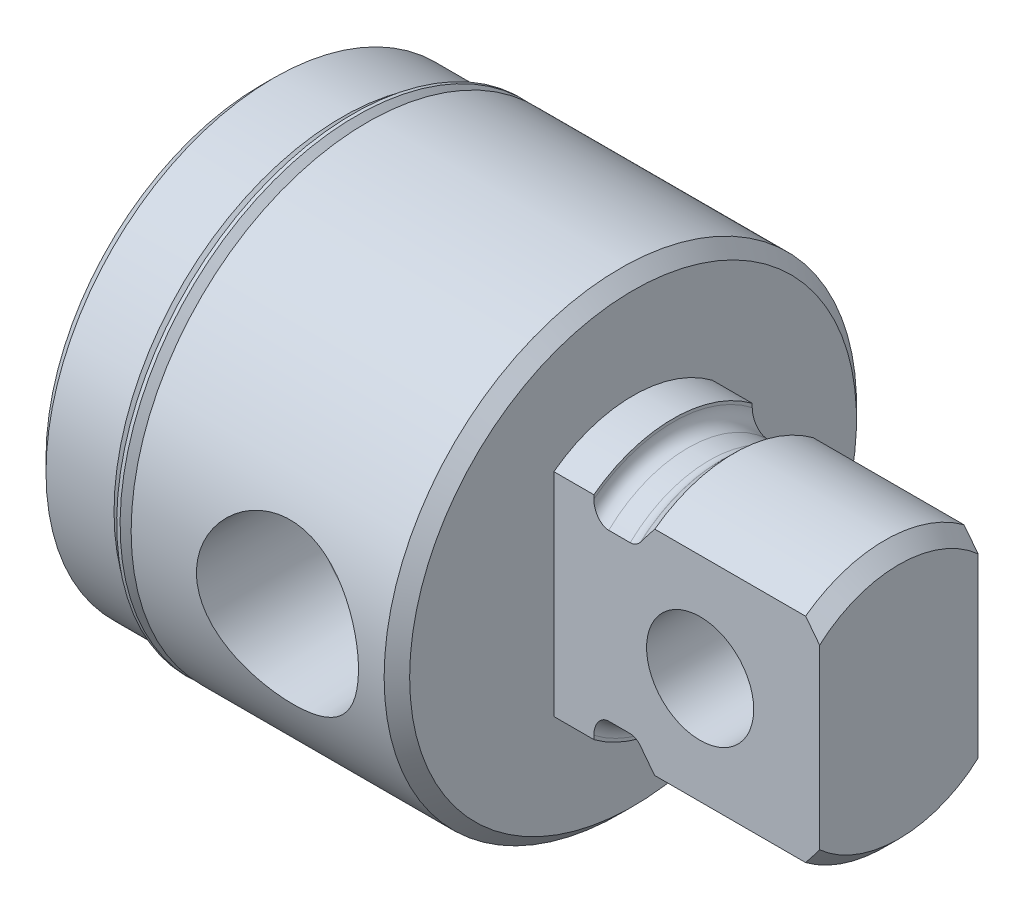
ISO-10303-21;
HEADER;
FILE_DESCRIPTION(('STEP AP214'),'2;1');
FILE_NAME('part.step','',(''),(''),'','','');
FILE_SCHEMA(('AUTOMOTIVE_DESIGN { 1 0 10303 214 1 1 1 1 }'));
ENDSEC;
DATA;
#1=APPLICATION_CONTEXT('core data for automotive mechanical design processes');
#2=APPLICATION_PROTOCOL_DEFINITION('international standard','automotive_design',2000,#1);
#3=PRODUCT_CONTEXT('',#1,'mechanical');
#4=PRODUCT('Part','Part','',(#3));
#5=PRODUCT_RELATED_PRODUCT_CATEGORY('part','',(#4));
#6=PRODUCT_DEFINITION_FORMATION('','',#4);
#7=PRODUCT_DEFINITION_CONTEXT('part definition',#1,'design');
#8=PRODUCT_DEFINITION('design','',#6,#7);
#9=PRODUCT_DEFINITION_SHAPE('','',#8);
#10=(LENGTH_UNIT() NAMED_UNIT(*) SI_UNIT(.MILLI.,.METRE.));
#11=(NAMED_UNIT(*) PLANE_ANGLE_UNIT() SI_UNIT($,.RADIAN.));
#12=(NAMED_UNIT(*) SI_UNIT($,.STERADIAN.) SOLID_ANGLE_UNIT());
#13=UNCERTAINTY_MEASURE_WITH_UNIT(LENGTH_MEASURE(1.E-05),#10,'distance_accuracy_value','');
#14=(GEOMETRIC_REPRESENTATION_CONTEXT(3) GLOBAL_UNCERTAINTY_ASSIGNED_CONTEXT((#13)) GLOBAL_UNIT_ASSIGNED_CONTEXT((#10,
#11,#12)) REPRESENTATION_CONTEXT('',''));
#15=CARTESIAN_POINT('',(0.,0.,0.));
#16=DIRECTION('',(0.,0.,1.));
#17=DIRECTION('',(1.,0.,0.));
#18=AXIS2_PLACEMENT_3D('',#15,#16,#17);
#19=CARTESIAN_POINT('',(22.225,0.,0.));
#20=DIRECTION('',(-1.,0.,0.));
#21=DIRECTION('',(0.,0.,1.));
#22=AXIS2_PLACEMENT_3D('',#19,#20,#21);
#23=CYLINDRICAL_SURFACE('',#22,12.84605);
#24=CARTESIAN_POINT('',(5.588,0.,0.));
#25=DIRECTION('',(-1.,0.,0.));
#26=DIRECTION('',(0.,0.,1.));
#27=AXIS2_PLACEMENT_3D('',#24,#25,#26);
#28=CIRCLE('',#27,12.84605);
#29=CARTESIAN_POINT('',(5.588,0.,12.84605));
#30=VERTEX_POINT('',#29);
#31=EDGE_CURVE('E164',#30,#30,#28,.T.);
#32=ORIENTED_EDGE('',*,*,#31,.F.);
#33=EDGE_LOOP('',(#32));
#34=FACE_BOUND('',#33,.T.);
#35=CARTESIAN_POINT('',(5.9689999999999,0.,0.));
#36=DIRECTION('',(1.,0.,0.));
#37=DIRECTION('',(0.,1.,0.));
#38=AXIS2_PLACEMENT_3D('',#35,#36,#37);
#39=CIRCLE('',#38,12.84605);
#40=CARTESIAN_POINT('',(5.969,12.84605,0.));
#41=VERTEX_POINT('',#40);
#42=EDGE_CURVE('E1056',#41,#41,#39,.T.);
#43=ORIENTED_EDGE('',*,*,#42,.F.);
#44=EDGE_LOOP('',(#43));
#45=FACE_BOUND('',#44,.T.);
#46=ADVANCED_FACE('F17',(#34,#45),#23,.T.);
#47=CARTESIAN_POINT('',(6.22751280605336,0.,0.));
#48=DIRECTION('',(1.,0.,0.));
#49=DIRECTION('',(0.,1.,0.));
#50=AXIS2_PLACEMENT_3D('',#47,#48,#49);
#51=CONICAL_SURFACE('',#50,13.1045628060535,0.785398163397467);
#52=CARTESIAN_POINT('',(6.22751280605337,0.,0.));
#53=DIRECTION('',(1.,0.,0.));
#54=DIRECTION('',(0.,1.,0.));
#55=AXIS2_PLACEMENT_3D('',#52,#53,#54);
#56=CIRCLE('',#55,13.1045628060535);
#57=CARTESIAN_POINT('',(6.22751280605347,13.1045628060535,0.));
#58=VERTEX_POINT('',#57);
#59=EDGE_CURVE('E357',#58,#58,#56,.F.);
#60=ORIENTED_EDGE('',*,*,#59,.T.);
#61=EDGE_LOOP('',(#60));
#62=FACE_BOUND('',#61,.T.);
#63=ORIENTED_EDGE('',*,*,#42,.T.);
#64=EDGE_LOOP('',(#63));
#65=FACE_BOUND('',#64,.T.);
#66=ADVANCED_FACE('F976',(#62,#65),#51,.T.);
#67=CARTESIAN_POINT('',(4.826,0.,0.));
#68=DIRECTION('',(-1.,0.,0.));
#69=DIRECTION('',(0.,0.,1.));
#70=AXIS2_PLACEMENT_3D('',#67,#68,#69);
#71=CONICAL_SURFACE('',#70,13.60805,0.78539816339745);
#72=CARTESIAN_POINT('',(4.826,0.,0.));
#73=DIRECTION('',(-1.,0.,0.));
#74=DIRECTION('',(0.,0.,1.));
#75=AXIS2_PLACEMENT_3D('',#72,#73,#74);
#76=CIRCLE('',#75,13.60805);
#77=CARTESIAN_POINT('',(4.826,0.,13.60805));
#78=VERTEX_POINT('',#77);
#79=EDGE_CURVE('E353',#78,#78,#76,.T.);
#80=ORIENTED_EDGE('',*,*,#79,.F.);
#81=EDGE_LOOP('',(#80));
#82=FACE_BOUND('',#81,.T.);
#83=ORIENTED_EDGE('',*,*,#31,.T.);
#84=EDGE_LOOP('',(#83));
#85=FACE_BOUND('',#84,.T.);
#86=ADVANCED_FACE('F407',(#82,#85),#71,.T.);
#87=CARTESIAN_POINT('',(26.7843,0.,0.));
#88=DIRECTION('',(1.,0.,0.));
#89=DIRECTION('',(0.,0.,-1.));
#90=AXIS2_PLACEMENT_3D('',#87,#88,#89);
#91=TOROIDAL_SURFACE('',#90,7.72795,0.888999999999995);
#92=CARTESIAN_POINT('',(26.7843,0.,0.));
#93=DIRECTION('',(-1.,0.,0.));
#94=DIRECTION('',(0.,0.,1.));
#95=AXIS2_PLACEMENT_3D('',#92,#93,#94);
#96=CIRCLE('',#95,6.83895);
#97=CARTESIAN_POINT('',(26.7843,4.93874898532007,4.73075));
#98=VERTEX_POINT('',#97);
#99=CARTESIAN_POINT('',(26.7843,4.93874898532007,-4.73075));
#100=VERTEX_POINT('',#99);
#101=EDGE_CURVE('E160',#98,#100,#96,.T.);
#102=ORIENTED_EDGE('',*,*,#101,.F.);
#103=CARTESIAN_POINT('',(27.3829929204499,5.25507076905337,4.73075));
#104=CARTESIAN_POINT('',(27.352131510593,5.21723197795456,4.73075));
#105=CARTESIAN_POINT('',(27.3185992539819,5.18131810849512,4.73075));
#106=CARTESIAN_POINT('',(27.2461172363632,5.11470482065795,4.73075));
#107=CARTESIAN_POINT('',(27.2071170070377,5.08406069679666,4.73075));
#108=CARTESIAN_POINT('',(27.1314381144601,5.03484747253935,4.73075));
#109=CARTESIAN_POINT('',(27.0955313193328,5.01510572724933,4.73075));
#110=CARTESIAN_POINT('',(27.0211070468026,4.98192537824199,4.73075));
#111=CARTESIAN_POINT('',(26.9826061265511,4.96845046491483,4.73075));
#112=CARTESIAN_POINT('',(26.9173320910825,4.95205818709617,4.73075));
#113=CARTESIAN_POINT('',(26.8910601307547,4.9471054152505,4.73075));
#114=CARTESIAN_POINT('',(26.8379683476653,4.94043301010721,4.73075));
#115=CARTESIAN_POINT('',(26.8111463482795,4.93873078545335,4.73075));
#116=CARTESIAN_POINT('',(26.7843,4.93874898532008,4.73075));
#117=B_SPLINE_CURVE_WITH_KNOTS('',3,(#103,#104,#105,#106,#107,#108,#109,#110,#111,#112,#113,
#114,#115,#116),.UNSPECIFIED.,.F.,.F.,(4,2,2,2,2,2,4),(0.,0.146689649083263,0.294835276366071,
0.41726884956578,0.538983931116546,0.618998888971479,0.699441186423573),.UNSPECIFIED.);
#118=CARTESIAN_POINT('',(27.3829929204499,5.25507076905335,4.73075));
#119=VERTEX_POINT('',#118);
#120=EDGE_CURVE('E20',#119,#98,#117,.T.);
#121=ORIENTED_EDGE('',*,*,#120,.F.);
#122=CARTESIAN_POINT('',(27.38299292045,0.,0.));
#123=DIRECTION('',(1.,0.,0.));
#124=DIRECTION('',(0.,0.,-1.));
#125=AXIS2_PLACEMENT_3D('',#122,#123,#124);
#126=CIRCLE('',#125,7.07076829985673);
#127=CARTESIAN_POINT('',(27.3829929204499,5.25507076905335,-4.73075));
#128=VERTEX_POINT('',#127);
#129=EDGE_CURVE('E157',#128,#119,#126,.T.);
#130=ORIENTED_EDGE('',*,*,#129,.F.);
#131=CARTESIAN_POINT('',(26.7843,4.93874898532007,-4.73075));
#132=CARTESIAN_POINT('',(26.8047112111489,4.93874476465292,-4.73075));
#133=CARTESIAN_POINT('',(26.8251096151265,4.93972327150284,-4.73075));
#134=CARTESIAN_POINT('',(26.8657071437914,4.94359740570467,-4.73075));
#135=CARTESIAN_POINT('',(26.8859064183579,4.94649145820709,-4.73075));
#136=CARTESIAN_POINT('',(26.9455338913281,4.95788871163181,-4.73075));
#137=CARTESIAN_POINT('',(26.9844692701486,4.96910959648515,-4.73075));
#138=CARTESIAN_POINT('',(27.0597113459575,4.99790587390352,-4.73075));
#139=CARTESIAN_POINT('',(27.0960254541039,5.01546243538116,-4.73075));
#140=CARTESIAN_POINT('',(27.1657163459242,5.05593210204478,-4.73075));
#141=CARTESIAN_POINT('',(27.1990795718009,5.07886832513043,-4.73075));
#142=CARTESIAN_POINT('',(27.2589305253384,5.12625310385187,-4.73075));
#143=CARTESIAN_POINT('',(27.2857712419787,5.15026346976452,-4.73075));
#144=CARTESIAN_POINT('',(27.3365157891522,5.20086377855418,-4.73075));
#145=CARTESIAN_POINT('',(27.3604398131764,5.22743339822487,-4.73075));
#146=CARTESIAN_POINT('',(27.3829929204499,5.25507076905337,-4.73075));
#147=B_SPLINE_CURVE_WITH_KNOTS('',3,(#131,#132,#133,#134,#135,#136,#137,#138,#139,#140,#141,
#142,#143,#144,#145,#146),.UNSPECIFIED.,.F.,.F.,(4,2,2,2,2,2,2,4),(0.,0.0611860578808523,
0.122321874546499,0.243183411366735,0.363688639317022,0.484721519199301,0.592546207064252,
0.699575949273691),.UNSPECIFIED.);
#148=EDGE_CURVE('E163',#100,#128,#147,.T.);
#149=ORIENTED_EDGE('',*,*,#148,.F.);
#150=EDGE_LOOP('',(#102,#121,#130,#149));
#151=FACE_BOUND('',#150,.T.);
#152=ADVANCED_FACE('F154',(#151),#91,.F.);
#153=CARTESIAN_POINT('',(27.4129179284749,0.,0.));
#154=DIRECTION('',(1.,0.,0.));
#155=DIRECTION('',(0.,0.,-1.));
#156=AXIS2_PLACEMENT_3D('',#153,#154,#155);
#157=CONICAL_SURFACE('',#156,7.09802999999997,0.738859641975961);
#158=CARTESIAN_POINT('',(27.38299292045,5.25507076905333,4.73075));
#159=CARTESIAN_POINT('',(27.3879757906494,5.26117856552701,4.73075));
#160=CARTESIAN_POINT('',(27.3929609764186,5.26728446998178,4.73075));
#161=CARTESIAN_POINT('',(27.4029359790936,5.27949249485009,4.73075));
#162=CARTESIAN_POINT('',(27.4079257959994,5.28559461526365,4.73075));
#163=CARTESIAN_POINT('',(27.4129179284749,5.29169484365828,4.73075));
#164=B_SPLINE_CURVE_WITH_KNOTS('',3,(#158,#159,#160,#161,#162,#163),.UNSPECIFIED.,.F.,.F.,(4,2,
4),(0.,0.0236475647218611,0.0472951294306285),.UNSPECIFIED.);
#165=CARTESIAN_POINT('',(27.4129179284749,5.2916948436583,4.73075));
#166=VERTEX_POINT('',#165);
#167=EDGE_CURVE('E166',#119,#166,#164,.T.);
#168=ORIENTED_EDGE('',*,*,#167,.T.);
#169=CARTESIAN_POINT('',(27.4129179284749,0.,0.));
#170=DIRECTION('',(1.,0.,0.));
#171=DIRECTION('',(0.,0.,-1.));
#172=AXIS2_PLACEMENT_3D('',#169,#170,#171);
#173=CIRCLE('',#172,7.09803);
#174=CARTESIAN_POINT('',(27.4129179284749,5.29169484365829,-4.73075));
#175=VERTEX_POINT('',#174);
#176=EDGE_CURVE('E398',#175,#166,#173,.T.);
#177=ORIENTED_EDGE('',*,*,#176,.F.);
#178=CARTESIAN_POINT('',(27.4129179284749,5.29169484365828,-4.73075));
#179=CARTESIAN_POINT('',(27.4079257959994,5.28559461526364,-4.73075));
#180=CARTESIAN_POINT('',(27.4029359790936,5.27949249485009,-4.73075));
#181=CARTESIAN_POINT('',(27.3929609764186,5.26728446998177,-4.73075));
#182=CARTESIAN_POINT('',(27.3879757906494,5.26117856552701,-4.73075));
#183=CARTESIAN_POINT('',(27.38299292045,5.25507076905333,-4.73075));
#184=B_SPLINE_CURVE_WITH_KNOTS('',3,(#178,#179,#180,#181,#182,#183),.UNSPECIFIED.,.F.,.F.,(4,2,
4),(0.,0.0236475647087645,0.0472951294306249),.UNSPECIFIED.);
#185=EDGE_CURVE('E177',#175,#128,#184,.T.);
#186=ORIENTED_EDGE('',*,*,#185,.T.);
#187=ORIENTED_EDGE('',*,*,#129,.T.);
#188=EDGE_LOOP('',(#168,#177,#186,#187));
#189=FACE_BOUND('',#188,.T.);
#190=ADVANCED_FACE('F176',(#189),#157,.T.);
#191=CARTESIAN_POINT('',(27.4129179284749,0.,0.));
#192=DIRECTION('',(1.,0.,0.));
#193=DIRECTION('',(0.,0.,-1.));
#194=AXIS2_PLACEMENT_3D('',#191,#192,#193);
#195=CONICAL_SURFACE('',#194,7.09802999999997,0.738859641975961);
#196=CARTESIAN_POINT('',(27.38299292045,-5.25507076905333,-4.73075));
#197=CARTESIAN_POINT('',(27.3879757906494,-5.26117856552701,-4.73075));
#198=CARTESIAN_POINT('',(27.3929609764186,-5.26728446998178,-4.73075));
#199=CARTESIAN_POINT('',(27.4029359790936,-5.27949249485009,-4.73075));
#200=CARTESIAN_POINT('',(27.4079257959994,-5.28559461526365,-4.73075));
#201=CARTESIAN_POINT('',(27.4129179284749,-5.29169484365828,-4.73075));
#202=B_SPLINE_CURVE_WITH_KNOTS('',3,(#196,#197,#198,#199,#200,#201),.UNSPECIFIED.,.F.,.F.,(4,2,
4),(0.,0.0236475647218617,0.0472951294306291),.UNSPECIFIED.);
#203=CARTESIAN_POINT('',(27.3829929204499,-5.25507076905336,-4.73075));
#204=VERTEX_POINT('',#203);
#205=CARTESIAN_POINT('',(27.4129179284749,-5.2916948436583,-4.73075));
#206=VERTEX_POINT('',#205);
#207=EDGE_CURVE('E389',#204,#206,#202,.T.);
#208=ORIENTED_EDGE('',*,*,#207,.T.);
#209=CARTESIAN_POINT('',(27.4129179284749,0.,0.));
#210=DIRECTION('',(1.,0.,0.));
#211=DIRECTION('',(0.,0.,-1.));
#212=AXIS2_PLACEMENT_3D('',#209,#210,#211);
#213=CIRCLE('',#212,7.09803);
#214=CARTESIAN_POINT('',(27.4129179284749,-5.29169484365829,4.73075));
#215=VERTEX_POINT('',#214);
#216=EDGE_CURVE('E393',#215,#206,#213,.T.);
#217=ORIENTED_EDGE('',*,*,#216,.F.);
#218=CARTESIAN_POINT('',(27.4129179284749,-5.29169484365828,4.73075));
#219=CARTESIAN_POINT('',(27.4079257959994,-5.28559461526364,4.73075));
#220=CARTESIAN_POINT('',(27.4029359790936,-5.27949249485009,4.73075));
#221=CARTESIAN_POINT('',(27.3929609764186,-5.26728446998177,4.73075));
#222=CARTESIAN_POINT('',(27.3879757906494,-5.26117856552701,4.73075));
#223=CARTESIAN_POINT('',(27.38299292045,-5.25507076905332,4.73075));
#224=B_SPLINE_CURVE_WITH_KNOTS('',3,(#218,#219,#220,#221,#222,#223),.UNSPECIFIED.,.F.,.F.,(4,2,
4),(0.,0.0236475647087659,0.0472951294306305),.UNSPECIFIED.);
#225=CARTESIAN_POINT('',(27.3829929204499,-5.25507076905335,4.73075));
#226=VERTEX_POINT('',#225);
#227=EDGE_CURVE('E174',#215,#226,#224,.T.);
#228=ORIENTED_EDGE('',*,*,#227,.T.);
#229=CARTESIAN_POINT('',(27.3829929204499,0.,0.));
#230=DIRECTION('',(1.,0.,0.));
#231=DIRECTION('',(0.,0.,-1.));
#232=AXIS2_PLACEMENT_3D('',#229,#230,#231);
#233=CIRCLE('',#232,7.07076829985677);
#234=EDGE_CURVE('E385',#226,#204,#233,.T.);
#235=ORIENTED_EDGE('',*,*,#234,.T.);
#236=EDGE_LOOP('',(#208,#217,#228,#235));
#237=FACE_BOUND('',#236,.T.);
#238=ADVANCED_FACE('F376',(#237),#195,.T.);
#239=CARTESIAN_POINT('',(26.7843,0.,0.));
#240=DIRECTION('',(1.,0.,0.));
#241=DIRECTION('',(0.,0.,-1.));
#242=AXIS2_PLACEMENT_3D('',#239,#240,#241);
#243=TOROIDAL_SURFACE('',#242,7.72795,0.888999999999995);
#244=CARTESIAN_POINT('',(26.7842999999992,0.,0.));
#245=DIRECTION('',(-1.,0.,0.));
#246=DIRECTION('',(0.,0.,1.));
#247=AXIS2_PLACEMENT_3D('',#244,#245,#246);
#248=CIRCLE('',#247,6.83895);
#249=CARTESIAN_POINT('',(26.7842999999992,-4.93874898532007,-4.73075));
#250=VERTEX_POINT('',#249);
#251=CARTESIAN_POINT('',(26.7842999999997,-4.9387489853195,4.7307500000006));
#252=VERTEX_POINT('',#251);
#253=EDGE_CURVE('E349',#250,#252,#248,.T.);
#254=ORIENTED_EDGE('',*,*,#253,.F.);
#255=CARTESIAN_POINT('',(27.3829929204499,-5.25507076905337,-4.73075));
#256=CARTESIAN_POINT('',(27.352131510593,-5.21723197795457,-4.73075));
#257=CARTESIAN_POINT('',(27.3185992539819,-5.18131810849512,-4.73075));
#258=CARTESIAN_POINT('',(27.2461172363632,-5.11470482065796,-4.73075));
#259=CARTESIAN_POINT('',(27.2071170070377,-5.08406069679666,-4.73075));
#260=CARTESIAN_POINT('',(27.1314381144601,-5.03484747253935,-4.73075));
#261=CARTESIAN_POINT('',(27.0955313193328,-5.01510572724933,-4.73075));
#262=CARTESIAN_POINT('',(27.0211070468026,-4.98192537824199,-4.73075));
#263=CARTESIAN_POINT('',(26.9826061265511,-4.96845046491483,-4.73075));
#264=CARTESIAN_POINT('',(26.9173320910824,-4.95205818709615,-4.73075));
#265=CARTESIAN_POINT('',(26.8910601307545,-4.94710541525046,-4.73075));
#266=CARTESIAN_POINT('',(26.8379683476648,-4.94043301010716,-4.73075));
#267=CARTESIAN_POINT('',(26.8111463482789,-4.93873078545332,-4.73075));
#268=CARTESIAN_POINT('',(26.7842999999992,-4.93874898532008,-4.73075));
#269=B_SPLINE_CURVE_WITH_KNOTS('',3,(#255,#256,#257,#258,#259,#260,#261,#262,#263,#264,#265,
#266,#267,#268),.UNSPECIFIED.,.F.,.F.,(4,2,2,2,2,2,4),(0.,0.146689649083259,0.294835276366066,
0.417268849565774,0.538983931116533,0.618998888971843,0.699441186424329),.UNSPECIFIED.);
#270=EDGE_CURVE('E388',#204,#250,#269,.T.);
#271=ORIENTED_EDGE('',*,*,#270,.F.);
#272=ORIENTED_EDGE('',*,*,#234,.F.);
#273=CARTESIAN_POINT('',(26.7843000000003,-4.93874898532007,4.73075));
#274=CARTESIAN_POINT('',(26.8047112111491,-4.93874476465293,4.73075));
#275=CARTESIAN_POINT('',(26.8251096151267,-4.93972327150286,4.73075));
#276=CARTESIAN_POINT('',(26.8657071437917,-4.9435974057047,4.73075));
#277=CARTESIAN_POINT('',(26.8859064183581,-4.94649145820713,4.73075));
#278=CARTESIAN_POINT('',(26.9455338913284,-4.95788871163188,4.73075));
#279=CARTESIAN_POINT('',(26.9844692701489,-4.96910959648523,4.73075));
#280=CARTESIAN_POINT('',(27.0597113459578,-4.99790587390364,4.73075));
#281=CARTESIAN_POINT('',(27.0960254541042,-5.01546243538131,4.73075));
#282=CARTESIAN_POINT('',(27.1657163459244,-5.05593210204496,4.73075));
#283=CARTESIAN_POINT('',(27.1990795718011,-5.07886832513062,4.73075));
#284=CARTESIAN_POINT('',(27.2589305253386,-5.12625310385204,4.73075));
#285=CARTESIAN_POINT('',(27.2857712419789,-5.15026346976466,4.73075));
#286=CARTESIAN_POINT('',(27.3365157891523,-5.20086377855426,4.73075));
#287=CARTESIAN_POINT('',(27.3604398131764,-5.22743339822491,4.73075));
#288=CARTESIAN_POINT('',(27.3829929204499,-5.25507076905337,4.73075));
#289=B_SPLINE_CURVE_WITH_KNOTS('',3,(#273,#274,#275,#276,#277,#278,#279,#280,#281,#282,#283,
#284,#285,#286,#287,#288),.UNSPECIFIED.,.F.,.F.,(4,2,2,2,2,2,2,4),(0.,0.061186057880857,
0.122321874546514,0.243183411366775,0.363688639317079,0.484721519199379,0.592546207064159,
0.699575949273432),.UNSPECIFIED.);
#290=EDGE_CURVE('E520',#252,#226,#289,.T.);
#291=ORIENTED_EDGE('',*,*,#290,.F.);
#292=EDGE_LOOP('',(#254,#271,#272,#291));
#293=FACE_BOUND('',#292,.T.);
#294=ADVANCED_FACE('F369',(#293),#243,.F.);
#295=CARTESIAN_POINT('',(6.13771024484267,0.,0.));
#296=DIRECTION('',(1.,0.,0.));
#297=DIRECTION('',(0.,1.,0.));
#298=AXIS2_PLACEMENT_3D('',#295,#296,#297);
#299=TOROIDAL_SURFACE('',#298,13.1943653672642,0.127);
#300=ORIENTED_EDGE('',*,*,#59,.F.);
#301=EDGE_LOOP('',(#300));
#302=FACE_BOUND('',#301,.T.);
#303=CARTESIAN_POINT('',(6.22751280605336,0.,0.));
#304=DIRECTION('',(-1.,0.,0.));
#305=DIRECTION('',(0.,-1.,0.));
#306=AXIS2_PLACEMENT_3D('',#303,#304,#305);
#307=CIRCLE('',#306,13.2841679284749);
#308=CARTESIAN_POINT('',(6.22751280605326,-13.2841679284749,0.));
#309=VERTEX_POINT('',#308);
#310=EDGE_CURVE('E392',#309,#309,#307,.T.);
#311=ORIENTED_EDGE('',*,*,#310,.T.);
#312=EDGE_LOOP('',(#311));
#313=FACE_BOUND('',#312,.T.);
#314=ADVANCED_FACE('F364',(#302,#313),#299,.F.);
#315=CARTESIAN_POINT('',(22.225,0.,0.));
#316=DIRECTION('',(-1.,0.,0.));
#317=DIRECTION('',(0.,0.,1.));
#318=AXIS2_PLACEMENT_3D('',#315,#316,#317);
#319=CYLINDRICAL_SURFACE('',#318,13.60805);
#320=CARTESIAN_POINT('',(0.761999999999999,0.,0.));
#321=DIRECTION('',(1.,0.,0.));
#322=DIRECTION('',(0.,0.,-1.));
#323=AXIS2_PLACEMENT_3D('',#320,#321,#322);
#324=CIRCLE('',#323,13.60805);
#325=CARTESIAN_POINT('',(0.761999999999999,0.,-13.60805));
#326=VERTEX_POINT('',#325);
#327=EDGE_CURVE('E638',#326,#326,#324,.F.);
#328=ORIENTED_EDGE('',*,*,#327,.F.);
#329=EDGE_LOOP('',(#328));
#330=FACE_BOUND('',#329,.T.);
#331=ORIENTED_EDGE('',*,*,#79,.T.);
#332=EDGE_LOOP('',(#331));
#333=FACE_BOUND('',#332,.T.);
#334=ADVANCED_FACE('F368',(#330,#333),#319,.T.);
#335=CARTESIAN_POINT('',(38.1,0.,0.));
#336=DIRECTION('',(-1.,0.,0.));
#337=DIRECTION('',(0.,0.,1.));
#338=AXIS2_PLACEMENT_3D('',#335,#336,#337);
#339=CYLINDRICAL_SURFACE('',#338,6.83895);
#340=DIRECTION('',(-1.,0.,0.));
#341=VECTOR('',#340,1.);
#342=CARTESIAN_POINT('',(38.1,4.93874898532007,4.73075));
#343=LINE('',#342,#341);
#344=CARTESIAN_POINT('',(25.5016,4.93874898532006,4.73075));
#345=VERTEX_POINT('',#344);
#346=EDGE_CURVE('E352',#345,#98,#343,.F.);
#347=ORIENTED_EDGE('',*,*,#346,.T.);
#348=ORIENTED_EDGE('',*,*,#101,.T.);
#349=DIRECTION('',(-1.,0.,0.));
#350=VECTOR('',#349,1.);
#351=CARTESIAN_POINT('',(38.1,4.93874898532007,-4.73075));
#352=LINE('',#351,#350);
#353=CARTESIAN_POINT('',(25.5016,4.93874898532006,-4.73075));
#354=VERTEX_POINT('',#353);
#355=EDGE_CURVE('E350',#100,#354,#352,.T.);
#356=ORIENTED_EDGE('',*,*,#355,.T.);
#357=CARTESIAN_POINT('',(25.5016,0.,0.));
#358=DIRECTION('',(1.,0.,0.));
#359=DIRECTION('',(0.,0.,-1.));
#360=AXIS2_PLACEMENT_3D('',#357,#358,#359);
#361=CIRCLE('',#360,6.83894999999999);
#362=EDGE_CURVE('E637',#354,#345,#361,.T.);
#363=ORIENTED_EDGE('',*,*,#362,.T.);
#364=EDGE_LOOP('',(#347,#348,#356,#363));
#365=FACE_BOUND('',#364,.T.);
#366=ADVANCED_FACE('F918',(#365),#339,.T.);
#367=CARTESIAN_POINT('',(28.2523879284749,0.,0.));
#368=DIRECTION('',(1.,0.,0.));
#369=DIRECTION('',(0.,1.,0.));
#370=AXIS2_PLACEMENT_3D('',#367,#368,#369);
#371=CONICAL_SURFACE('',#370,7.93750000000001,0.78539816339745);
#372=CARTESIAN_POINT('',(27.4129179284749,5.29169484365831,4.73075));
#373=CARTESIAN_POINT('',(27.4811376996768,5.38319681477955,4.73075));
#374=CARTESIAN_POINT('',(27.5498572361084,5.47432459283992,4.73075));
#375=CARTESIAN_POINT('',(27.688190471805,5.65588763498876,4.73075));
#376=CARTESIAN_POINT('',(27.7578040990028,5.74632295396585,4.73075));
#377=CARTESIAN_POINT('',(27.897830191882,5.9265704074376,4.73075));
#378=CARTESIAN_POINT('',(27.9682426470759,6.01638255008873,4.73075));
#379=CARTESIAN_POINT('',(28.1097927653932,6.19544536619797,4.73075));
#380=CARTESIAN_POINT('',(28.1809304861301,6.28469599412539,4.73075));
#381=CARTESIAN_POINT('',(28.2523879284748,6.37368893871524,4.73075));
#382=B_SPLINE_CURVE_WITH_KNOTS('',3,(#372,#373,#374,#375,#376,#377,#378,#379,#380,#381),
.UNSPECIFIED.,.F.,.F.,(4,2,2,2,4),(0.,0.342398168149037,0.684768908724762,1.0271351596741,
1.36952882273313),.UNSPECIFIED.);
#383=CARTESIAN_POINT('',(28.2523879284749,6.37368893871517,4.73075));
#384=VERTEX_POINT('',#383);
#385=EDGE_CURVE('E170',#166,#384,#382,.T.);
#386=ORIENTED_EDGE('',*,*,#385,.T.);
#387=CARTESIAN_POINT('',(28.2523879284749,0.,0.));
#388=DIRECTION('',(-1.,0.,0.));
#389=DIRECTION('',(0.,0.,1.));
#390=AXIS2_PLACEMENT_3D('',#387,#388,#389);
#391=CIRCLE('',#390,7.9375);
#392=CARTESIAN_POINT('',(28.2523879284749,6.37368893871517,-4.73075));
#393=VERTEX_POINT('',#392);
#394=EDGE_CURVE('E1081',#393,#384,#391,.F.);
#395=ORIENTED_EDGE('',*,*,#394,.F.);
#396=CARTESIAN_POINT('',(28.2523879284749,6.37368893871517,-4.73075));
#397=CARTESIAN_POINT('',(28.1809304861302,6.28469599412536,-4.73075));
#398=CARTESIAN_POINT('',(28.1097927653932,6.19544536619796,-4.73075));
#399=CARTESIAN_POINT('',(27.9682426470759,6.01638255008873,-4.73075));
#400=CARTESIAN_POINT('',(27.897830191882,5.9265704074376,-4.73075));
#401=CARTESIAN_POINT('',(27.7578040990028,5.74632295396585,-4.73075));
#402=CARTESIAN_POINT('',(27.688190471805,5.65588763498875,-4.73075));
#403=CARTESIAN_POINT('',(27.5498572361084,5.47432459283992,-4.73075));
#404=CARTESIAN_POINT('',(27.4811376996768,5.38319681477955,-4.73075));
#405=CARTESIAN_POINT('',(27.4129179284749,5.29169484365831,-4.73075));
#406=B_SPLINE_CURVE_WITH_KNOTS('',3,(#396,#397,#398,#399,#400,#401,#402,#403,#404,#405),
.UNSPECIFIED.,.F.,.F.,(4,2,2,2,4),(0.,0.342393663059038,0.684759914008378,1.0271306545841,
1.36952882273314),.UNSPECIFIED.);
#407=EDGE_CURVE('E400',#393,#175,#406,.T.);
#408=ORIENTED_EDGE('',*,*,#407,.T.);
#409=ORIENTED_EDGE('',*,*,#176,.T.);
#410=EDGE_LOOP('',(#386,#395,#408,#409));
#411=FACE_BOUND('',#410,.T.);
#412=ADVANCED_FACE('F909',(#411),#371,.T.);
#413=CARTESIAN_POINT('',(37.26053,0.,0.));
#414=DIRECTION('',(-1.,0.,0.));
#415=DIRECTION('',(0.,0.,1.));
#416=AXIS2_PLACEMENT_3D('',#413,#414,#415);
#417=CONICAL_SURFACE('',#416,7.9375,0.785398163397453);
#418=CARTESIAN_POINT('',(37.26053,6.37368893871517,4.73075));
#419=CARTESIAN_POINT('',(37.3319874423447,6.28469599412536,4.73075));
#420=CARTESIAN_POINT('',(37.4031251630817,6.19544536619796,4.73075));
#421=CARTESIAN_POINT('',(37.544675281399,6.01638255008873,4.73075));
#422=CARTESIAN_POINT('',(37.6150877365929,5.9265704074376,4.73075));
#423=CARTESIAN_POINT('',(37.755113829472,5.74632295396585,4.73075));
#424=CARTESIAN_POINT('',(37.8247274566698,5.65588763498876,4.73075));
#425=CARTESIAN_POINT('',(37.9630606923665,5.47432459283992,4.73075));
#426=CARTESIAN_POINT('',(38.0317802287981,5.38319681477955,4.73075));
#427=CARTESIAN_POINT('',(38.1,5.29169484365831,4.73075));
#428=B_SPLINE_CURVE_WITH_KNOTS('',3,(#418,#419,#420,#421,#422,#423,#424,#425,#426,#427),
.UNSPECIFIED.,.F.,.F.,(4,2,2,2,4),(0.,0.342393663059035,0.684759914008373,1.0271306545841,
1.36952882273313),.UNSPECIFIED.);
#429=CARTESIAN_POINT('',(37.26053,6.37368893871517,4.73075));
#430=VERTEX_POINT('',#429);
#431=CARTESIAN_POINT('',(38.1,5.29169484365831,4.73075));
#432=VERTEX_POINT('',#431);
#433=EDGE_CURVE('E511',#430,#432,#428,.T.);
#434=ORIENTED_EDGE('',*,*,#433,.T.);
#435=CARTESIAN_POINT('',(38.1,0.,0.));
#436=DIRECTION('',(-1.,0.,0.));
#437=DIRECTION('',(0.,0.,1.));
#438=AXIS2_PLACEMENT_3D('',#435,#436,#437);
#439=CIRCLE('',#438,7.09803);
#440=CARTESIAN_POINT('',(38.1,5.29169484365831,-4.73075));
#441=VERTEX_POINT('',#440);
#442=EDGE_CURVE('E1087',#432,#441,#439,.T.);
#443=ORIENTED_EDGE('',*,*,#442,.T.);
#444=CARTESIAN_POINT('',(38.1,5.29169484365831,-4.73075));
#445=CARTESIAN_POINT('',(38.0317802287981,5.38319681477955,-4.73075));
#446=CARTESIAN_POINT('',(37.9630606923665,5.47432459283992,-4.73075));
#447=CARTESIAN_POINT('',(37.8247274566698,5.65588763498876,-4.73075));
#448=CARTESIAN_POINT('',(37.755113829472,5.74632295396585,-4.73075));
#449=CARTESIAN_POINT('',(37.6150877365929,5.92657040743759,-4.73075));
#450=CARTESIAN_POINT('',(37.544675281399,6.01638255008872,-4.73075));
#451=CARTESIAN_POINT('',(37.4031251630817,6.19544536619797,-4.73075));
#452=CARTESIAN_POINT('',(37.3319874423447,6.28469599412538,-4.73075));
#453=CARTESIAN_POINT('',(37.2605300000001,6.37368893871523,-4.73075));
#454=B_SPLINE_CURVE_WITH_KNOTS('',3,(#444,#445,#446,#447,#448,#449,#450,#451,#452,#453),
.UNSPECIFIED.,.F.,.F.,(4,2,2,2,4),(0.,0.342398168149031,0.684768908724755,1.02713515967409,
1.36952882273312),.UNSPECIFIED.);
#455=CARTESIAN_POINT('',(37.26053,6.37368893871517,-4.73075));
#456=VERTEX_POINT('',#455);
#457=EDGE_CURVE('E452',#441,#456,#454,.T.);
#458=ORIENTED_EDGE('',*,*,#457,.T.);
#459=CARTESIAN_POINT('',(37.26053,0.,0.));
#460=DIRECTION('',(-1.,0.,0.));
#461=DIRECTION('',(0.,0.,1.));
#462=AXIS2_PLACEMENT_3D('',#459,#460,#461);
#463=CIRCLE('',#462,7.9375);
#464=EDGE_CURVE('E1084',#430,#456,#463,.T.);
#465=ORIENTED_EDGE('',*,*,#464,.F.);
#466=EDGE_LOOP('',(#434,#443,#458,#465));
#467=FACE_BOUND('',#466,.T.);
#468=ADVANCED_FACE('F900',(#467),#417,.T.);
#469=CARTESIAN_POINT('',(28.2523879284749,0.,0.));
#470=DIRECTION('',(1.,0.,0.));
#471=DIRECTION('',(0.,1.,0.));
#472=AXIS2_PLACEMENT_3D('',#469,#470,#471);
#473=CONICAL_SURFACE('',#472,7.93750000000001,0.78539816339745);
#474=CARTESIAN_POINT('',(27.4129179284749,-5.29169484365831,-4.73075));
#475=CARTESIAN_POINT('',(27.4811376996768,-5.38319681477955,-4.73075));
#476=CARTESIAN_POINT('',(27.5498572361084,-5.47432459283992,-4.73075));
#477=CARTESIAN_POINT('',(27.688190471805,-5.65588763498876,-4.73075));
#478=CARTESIAN_POINT('',(27.7578040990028,-5.74632295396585,-4.73075));
#479=CARTESIAN_POINT('',(27.897830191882,-5.92657040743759,-4.73075));
#480=CARTESIAN_POINT('',(27.9682426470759,-6.01638255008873,-4.73075));
#481=CARTESIAN_POINT('',(28.1097927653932,-6.19544536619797,-4.73075));
#482=CARTESIAN_POINT('',(28.1809304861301,-6.28469599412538,-4.73075));
#483=CARTESIAN_POINT('',(28.2523879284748,-6.37368893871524,-4.73075));
#484=B_SPLINE_CURVE_WITH_KNOTS('',3,(#474,#475,#476,#477,#478,#479,#480,#481,#482,#483),
.UNSPECIFIED.,.F.,.F.,(4,2,2,2,4),(0.,0.342398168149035,0.684768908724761,1.0271351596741,
1.36952882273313),.UNSPECIFIED.);
#485=CARTESIAN_POINT('',(28.2523879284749,-6.37368893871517,-4.73075));
#486=VERTEX_POINT('',#485);
#487=EDGE_CURVE('E396',#206,#486,#484,.T.);
#488=ORIENTED_EDGE('',*,*,#487,.T.);
#489=CARTESIAN_POINT('',(28.2523879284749,0.,0.));
#490=DIRECTION('',(-1.,0.,0.));
#491=DIRECTION('',(0.,0.,1.));
#492=AXIS2_PLACEMENT_3D('',#489,#490,#491);
#493=CIRCLE('',#492,7.9375);
#494=CARTESIAN_POINT('',(28.2523879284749,-6.37368893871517,4.73075));
#495=VERTEX_POINT('',#494);
#496=EDGE_CURVE('E1072',#495,#486,#493,.F.);
#497=ORIENTED_EDGE('',*,*,#496,.F.);
#498=CARTESIAN_POINT('',(28.2523879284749,-6.37368893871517,4.73075));
#499=CARTESIAN_POINT('',(28.1809304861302,-6.28469599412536,4.73075));
#500=CARTESIAN_POINT('',(28.1097927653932,-6.19544536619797,4.73075));
#501=CARTESIAN_POINT('',(27.9682426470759,-6.01638255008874,4.73075));
#502=CARTESIAN_POINT('',(27.897830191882,-5.9265704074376,4.73075));
#503=CARTESIAN_POINT('',(27.7578040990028,-5.74632295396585,4.73075));
#504=CARTESIAN_POINT('',(27.688190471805,-5.65588763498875,4.73075));
#505=CARTESIAN_POINT('',(27.5498572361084,-5.47432459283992,4.73075));
#506=CARTESIAN_POINT('',(27.4811376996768,-5.38319681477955,4.73075));
#507=CARTESIAN_POINT('',(27.4129179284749,-5.29169484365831,4.73075));
#508=B_SPLINE_CURVE_WITH_KNOTS('',3,(#498,#499,#500,#501,#502,#503,#504,#505,#506,#507),
.UNSPECIFIED.,.F.,.F.,(4,2,2,2,4),(0.,0.342393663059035,0.684759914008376,1.0271306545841,
1.36952882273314),.UNSPECIFIED.);
#509=EDGE_CURVE('E397',#495,#215,#508,.T.);
#510=ORIENTED_EDGE('',*,*,#509,.T.);
#511=ORIENTED_EDGE('',*,*,#216,.T.);
#512=EDGE_LOOP('',(#488,#497,#510,#511));
#513=FACE_BOUND('',#512,.T.);
#514=ADVANCED_FACE('F891',(#513),#473,.T.);
#515=CARTESIAN_POINT('',(37.26053,0.,0.));
#516=DIRECTION('',(-1.,0.,0.));
#517=DIRECTION('',(0.,0.,1.));
#518=AXIS2_PLACEMENT_3D('',#515,#516,#517);
#519=CONICAL_SURFACE('',#518,7.9375,0.785398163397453);
#520=CARTESIAN_POINT('',(37.26053,-6.37368893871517,-4.73075));
#521=CARTESIAN_POINT('',(37.3319874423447,-6.28469599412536,-4.73075));
#522=CARTESIAN_POINT('',(37.4031251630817,-6.19544536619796,-4.73075));
#523=CARTESIAN_POINT('',(37.544675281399,-6.01638255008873,-4.73075));
#524=CARTESIAN_POINT('',(37.6150877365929,-5.9265704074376,-4.73075));
#525=CARTESIAN_POINT('',(37.755113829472,-5.74632295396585,-4.73075));
#526=CARTESIAN_POINT('',(37.8247274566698,-5.65588763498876,-4.73075));
#527=CARTESIAN_POINT('',(37.9630606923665,-5.47432459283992,-4.73075));
#528=CARTESIAN_POINT('',(38.0317802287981,-5.38319681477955,-4.73075));
#529=CARTESIAN_POINT('',(38.1,-5.29169484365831,-4.73075));
#530=B_SPLINE_CURVE_WITH_KNOTS('',3,(#520,#521,#522,#523,#524,#525,#526,#527,#528,#529),
.UNSPECIFIED.,.F.,.F.,(4,2,2,2,4),(0.,0.342393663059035,0.684759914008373,1.0271306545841,
1.36952882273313),.UNSPECIFIED.);
#531=CARTESIAN_POINT('',(37.26053,-6.37368893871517,-4.73075));
#532=VERTEX_POINT('',#531);
#533=CARTESIAN_POINT('',(38.1,-5.29169484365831,-4.73075));
#534=VERTEX_POINT('',#533);
#535=EDGE_CURVE('E346',#532,#534,#530,.T.);
#536=ORIENTED_EDGE('',*,*,#535,.T.);
#537=CARTESIAN_POINT('',(38.1,0.,0.));
#538=DIRECTION('',(-1.,0.,0.));
#539=DIRECTION('',(0.,0.,1.));
#540=AXIS2_PLACEMENT_3D('',#537,#538,#539);
#541=CIRCLE('',#540,7.09803);
#542=CARTESIAN_POINT('',(38.1,-5.29169484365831,4.73075));
#543=VERTEX_POINT('',#542);
#544=EDGE_CURVE('E1089',#534,#543,#541,.T.);
#545=ORIENTED_EDGE('',*,*,#544,.T.);
#546=CARTESIAN_POINT('',(38.1,-5.29169484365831,4.73075));
#547=CARTESIAN_POINT('',(38.0317802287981,-5.38319681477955,4.73075));
#548=CARTESIAN_POINT('',(37.9630606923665,-5.47432459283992,4.73075));
#549=CARTESIAN_POINT('',(37.8247274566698,-5.65588763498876,4.73075));
#550=CARTESIAN_POINT('',(37.755113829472,-5.74632295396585,4.73075));
#551=CARTESIAN_POINT('',(37.6150877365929,-5.92657040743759,4.73075));
#552=CARTESIAN_POINT('',(37.544675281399,-6.01638255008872,4.73075));
#553=CARTESIAN_POINT('',(37.4031251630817,-6.19544536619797,4.73075));
#554=CARTESIAN_POINT('',(37.3319874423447,-6.28469599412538,4.73075));
#555=CARTESIAN_POINT('',(37.2605300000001,-6.37368893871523,4.73075));
#556=B_SPLINE_CURVE_WITH_KNOTS('',3,(#546,#547,#548,#549,#550,#551,#552,#553,#554,#555),
.UNSPECIFIED.,.F.,.F.,(4,2,2,2,4),(0.,0.342398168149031,0.684768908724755,1.02713515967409,
1.36952882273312),.UNSPECIFIED.);
#557=CARTESIAN_POINT('',(37.26053,-6.37368893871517,4.73075));
#558=VERTEX_POINT('',#557);
#559=EDGE_CURVE('E502',#543,#558,#556,.T.);
#560=ORIENTED_EDGE('',*,*,#559,.T.);
#561=CARTESIAN_POINT('',(37.26053,0.,0.));
#562=DIRECTION('',(-1.,0.,0.));
#563=DIRECTION('',(0.,0.,1.));
#564=AXIS2_PLACEMENT_3D('',#561,#562,#563);
#565=CIRCLE('',#564,7.9375);
#566=EDGE_CURVE('E542',#532,#558,#565,.T.);
#567=ORIENTED_EDGE('',*,*,#566,.F.);
#568=EDGE_LOOP('',(#536,#545,#560,#567));
#569=FACE_BOUND('',#568,.T.);
#570=ADVANCED_FACE('F882',(#569),#519,.T.);
#571=CARTESIAN_POINT('',(38.1,0.,0.));
#572=DIRECTION('',(-1.,0.,0.));
#573=DIRECTION('',(0.,0.,1.));
#574=AXIS2_PLACEMENT_3D('',#571,#572,#573);
#575=CYLINDRICAL_SURFACE('',#574,6.83895);
#576=DIRECTION('',(-1.,0.,0.));
#577=VECTOR('',#576,1.);
#578=CARTESIAN_POINT('',(38.1,-4.93874898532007,-4.73075));
#579=LINE('',#578,#577);
#580=CARTESIAN_POINT('',(25.5016,-4.93874898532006,-4.73075));
#581=VERTEX_POINT('',#580);
#582=EDGE_CURVE('E345',#581,#250,#579,.F.);
#583=ORIENTED_EDGE('',*,*,#582,.T.);
#584=ORIENTED_EDGE('',*,*,#253,.T.);
#585=DIRECTION('',(-1.,0.,0.));
#586=VECTOR('',#585,1.);
#587=CARTESIAN_POINT('',(38.1,-4.93874898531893,4.73075000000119));
#588=LINE('',#587,#586);
#589=CARTESIAN_POINT('',(25.5016,-4.93874898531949,4.73075000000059));
#590=VERTEX_POINT('',#589);
#591=EDGE_CURVE('E338',#252,#590,#588,.T.);
#592=ORIENTED_EDGE('',*,*,#591,.T.);
#593=CARTESIAN_POINT('',(25.5016,0.,0.));
#594=DIRECTION('',(1.,0.,0.));
#595=DIRECTION('',(0.,0.,-1.));
#596=AXIS2_PLACEMENT_3D('',#593,#594,#595);
#597=CIRCLE('',#596,6.83894999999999);
#598=EDGE_CURVE('E537',#590,#581,#597,.T.);
#599=ORIENTED_EDGE('',*,*,#598,.T.);
#600=EDGE_LOOP('',(#583,#584,#592,#599));
#601=FACE_BOUND('',#600,.T.);
#602=ADVANCED_FACE('F535',(#601),#575,.T.);
#603=CARTESIAN_POINT('',(5.48614893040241,0.,0.));
#604=DIRECTION('',(-1.,0.,0.));
#605=DIRECTION('',(0.,-1.,0.));
#606=AXIS2_PLACEMENT_3D('',#603,#604,#605);
#607=CONICAL_SURFACE('',#606,14.0255318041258,0.785398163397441);
#608=CARTESIAN_POINT('',(5.48614893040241,0.,0.));
#609=DIRECTION('',(-1.,0.,0.));
#610=DIRECTION('',(0.,-1.,0.));
#611=AXIS2_PLACEMENT_3D('',#608,#609,#610);
#612=CIRCLE('',#611,14.0255318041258);
#613=CARTESIAN_POINT('',(5.48614893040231,-14.0255318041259,0.));
#614=VERTEX_POINT('',#613);
#615=EDGE_CURVE('E656',#614,#614,#612,.F.);
#616=ORIENTED_EDGE('',*,*,#615,.F.);
#617=EDGE_LOOP('',(#616));
#618=FACE_BOUND('',#617,.T.);
#619=ORIENTED_EDGE('',*,*,#310,.F.);
#620=EDGE_LOOP('',(#619));
#621=FACE_BOUND('',#620,.T.);
#622=ADVANCED_FACE('F865',(#618,#621),#607,.F.);
#623=CARTESIAN_POINT('',(0.761999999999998,0.,0.));
#624=DIRECTION('',(1.,0.,0.));
#625=DIRECTION('',(0.,1.,0.));
#626=AXIS2_PLACEMENT_3D('',#623,#624,#625);
#627=CONICAL_SURFACE('',#626,13.60805,0.78539816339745);
#628=CARTESIAN_POINT('',(0.,0.,0.));
#629=DIRECTION('',(1.,0.,0.));
#630=DIRECTION('',(0.,1.,0.));
#631=AXIS2_PLACEMENT_3D('',#628,#629,#630);
#632=CIRCLE('',#631,12.84605);
#633=CARTESIAN_POINT('',(0.,12.84605,0.));
#634=VERTEX_POINT('',#633);
#635=EDGE_CURVE('E658',#634,#634,#632,.T.);
#636=ORIENTED_EDGE('',*,*,#635,.T.);
#637=EDGE_LOOP('',(#636));
#638=FACE_BOUND('',#637,.T.);
#639=ORIENTED_EDGE('',*,*,#327,.T.);
#640=EDGE_LOOP('',(#639));
#641=FACE_BOUND('',#640,.T.);
#642=ADVANCED_FACE('F614',(#638,#641),#627,.T.);
#643=CARTESIAN_POINT('',(24.6126,7.90575,0.));
#644=DIRECTION('',(-1.,0.,0.));
#645=DIRECTION('',(0.,0.,1.));
#646=AXIS2_PLACEMENT_3D('',#643,#644,#645);
#647=PLANE('',#646);
#648=CARTESIAN_POINT('',(24.6126,0.,0.));
#649=DIRECTION('',(-1.,0.,0.));
#650=DIRECTION('',(0.,0.,1.));
#651=AXIS2_PLACEMENT_3D('',#648,#649,#650);
#652=CIRCLE('',#651,7.90575);
#653=CARTESIAN_POINT('',(24.6126,-6.33410510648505,-4.73075));
#654=VERTEX_POINT('',#653);
#655=CARTESIAN_POINT('',(24.6126,-6.33410510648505,4.73075));
#656=VERTEX_POINT('',#655);
#657=EDGE_CURVE('E267',#654,#656,#652,.T.);
#658=ORIENTED_EDGE('',*,*,#657,.F.);
#659=DIRECTION('',(0.,1.,0.));
#660=VECTOR('',#659,1.);
#661=CARTESIAN_POINT('',(24.6126,7.90575,-4.73075));
#662=LINE('',#661,#660);
#663=CARTESIAN_POINT('',(24.6126,-6.11074591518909,-4.73075));
#664=VERTEX_POINT('',#663);
#665=EDGE_CURVE('E630',#664,#654,#662,.F.);
#666=ORIENTED_EDGE('',*,*,#665,.F.);
#667=CARTESIAN_POINT('',(24.6126,0.,0.));
#668=DIRECTION('',(1.,0.,0.));
#669=DIRECTION('',(0.,-0.790733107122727,0.612161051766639));
#670=AXIS2_PLACEMENT_3D('',#667,#668,#669);
#671=CIRCLE('',#670,7.72795000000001);
#672=CARTESIAN_POINT('',(24.6126,-6.11074591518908,4.73075));
#673=VERTEX_POINT('',#672);
#674=EDGE_CURVE('E541',#664,#673,#671,.F.);
#675=ORIENTED_EDGE('',*,*,#674,.T.);
#676=DIRECTION('',(0.,-1.,0.));
#677=VECTOR('',#676,1.);
#678=CARTESIAN_POINT('',(24.6126,28.2194,4.73075));
#679=LINE('',#678,#677);
#680=EDGE_CURVE('E282',#656,#673,#679,.F.);
#681=ORIENTED_EDGE('',*,*,#680,.F.);
#682=EDGE_LOOP('',(#658,#666,#675,#681));
#683=FACE_BOUND('',#682,.T.);
#684=ADVANCED_FACE('F606',(#683),#647,.F.);
#685=CARTESIAN_POINT('',(30.9626,0.,7.096125));
#686=DIRECTION('',(0.,0.,1.));
#687=DIRECTION('',(1.,0.,0.));
#688=AXIS2_PLACEMENT_3D('',#685,#686,#687);
#689=CYLINDRICAL_SURFACE('',#688,3.2004);
#690=CARTESIAN_POINT('',(30.9626,0.,4.73075));
#691=DIRECTION('',(0.,0.,1.));
#692=DIRECTION('',(1.,0.,0.));
#693=AXIS2_PLACEMENT_3D('',#690,#691,#692);
#694=CIRCLE('',#693,3.2004);
#695=CARTESIAN_POINT('',(34.163,0.,4.73075));
#696=VERTEX_POINT('',#695);
#697=EDGE_CURVE('E285',#696,#696,#694,.F.);
#698=ORIENTED_EDGE('',*,*,#697,.F.);
#699=EDGE_LOOP('',(#698));
#700=FACE_BOUND('',#699,.T.);
#701=CARTESIAN_POINT('',(30.9626,0.,-4.73075));
#702=DIRECTION('',(0.,0.,1.));
#703=DIRECTION('',(1.,0.,0.));
#704=AXIS2_PLACEMENT_3D('',#701,#702,#703);
#705=CIRCLE('',#704,3.2004);
#706=CARTESIAN_POINT('',(34.163,0.,-4.73075));
#707=VERTEX_POINT('',#706);
#708=EDGE_CURVE('E260',#707,#707,#705,.T.);
#709=ORIENTED_EDGE('',*,*,#708,.F.);
#710=EDGE_LOOP('',(#709));
#711=FACE_BOUND('',#710,.T.);
#712=ADVANCED_FACE('F603',(#700,#711),#689,.F.);
#713=CARTESIAN_POINT('',(25.5016,0.,0.));
#714=DIRECTION('',(1.,0.,0.));
#715=DIRECTION('',(0.,0.,-1.));
#716=AXIS2_PLACEMENT_3D('',#713,#714,#715);
#717=TOROIDAL_SURFACE('',#716,7.72795,0.889000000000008);
#718=CARTESIAN_POINT('',(24.6126,0.,0.));
#719=DIRECTION('',(1.,0.,0.));
#720=DIRECTION('',(0.,0.790733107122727,-0.612161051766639));
#721=AXIS2_PLACEMENT_3D('',#718,#719,#720);
#722=CIRCLE('',#721,7.72795);
#723=CARTESIAN_POINT('',(24.6126,6.11074591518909,-4.73075));
#724=VERTEX_POINT('',#723);
#725=CARTESIAN_POINT('',(24.6126,6.11074591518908,4.73075));
#726=VERTEX_POINT('',#725);
#727=EDGE_CURVE('E293',#724,#726,#722,.T.);
#728=ORIENTED_EDGE('',*,*,#727,.T.);
#729=CARTESIAN_POINT('',(25.5016,4.93874898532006,4.73075));
#730=CARTESIAN_POINT('',(25.4812089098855,4.93874473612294,4.73075));
#731=CARTESIAN_POINT('',(25.4608305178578,4.93972133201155,4.73075));
#732=CARTESIAN_POINT('',(25.4202726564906,4.94358791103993,4.73075));
#733=CARTESIAN_POINT('',(25.4000930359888,4.94647630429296,4.73075));
#734=CARTESIAN_POINT('',(25.3404441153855,4.95786622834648,4.73075));
#735=CARTESIAN_POINT('',(25.3014690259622,4.96909457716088,4.73075));
#736=CARTESIAN_POINT('',(25.2261507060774,4.9979207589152,4.73075));
#737=CARTESIAN_POINT('',(25.1898000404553,5.01549967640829,4.73075));
#738=CARTESIAN_POINT('',(25.1201201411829,5.05597504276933,4.73075));
#739=CARTESIAN_POINT('',(25.0867983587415,5.07888413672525,4.73075));
#740=CARTESIAN_POINT('',(25.0105589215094,5.13924789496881,4.73075));
#741=CARTESIAN_POINT('',(24.9693139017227,5.17881389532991,4.73075));
#742=CARTESIAN_POINT('',(24.8937156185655,5.26405000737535,4.73075));
#743=CARTESIAN_POINT('',(24.859375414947,5.30973141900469,4.73075));
#744=CARTESIAN_POINT('',(24.7881964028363,5.41981828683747,4.73075));
#745=CARTESIAN_POINT('',(24.7536928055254,5.48573242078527,4.73075));
#746=CARTESIAN_POINT('',(24.6958535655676,5.62226251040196,4.73075));
#747=CARTESIAN_POINT('',(24.6725254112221,5.69288158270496,4.73075));
#748=CARTESIAN_POINT('',(24.6407687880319,5.82148518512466,4.73075));
#749=CARTESIAN_POINT('',(24.6302255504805,5.87895867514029,4.73075000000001));
#750=CARTESIAN_POINT('',(24.6161640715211,5.99453220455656,4.73074999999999));
#751=CARTESIAN_POINT('',(24.6126187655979,6.05262895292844,4.73074999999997));
#752=CARTESIAN_POINT('',(24.6126,6.11074591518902,4.73074999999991));
#753=B_SPLINE_CURVE_WITH_KNOTS('',3,(#729,#730,#731,#732,#733,#734,#735,#736,#737,#738,#739,
#740,#741,#742,#743,#744,#745,#746,#747,#748,#749,#750,#751,#752),.UNSPECIFIED.,.F.,.F.,(4,2,2,
2,2,2,2,2,2,2,2,4),(0.,0.0611259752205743,0.122201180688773,0.243183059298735,0.363807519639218,
0.484721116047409,0.655247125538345,0.826092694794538,1.04813692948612,1.27032974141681,
1.4452173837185,1.6194273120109),.UNSPECIFIED.);
#754=EDGE_CURVE('E270',#345,#726,#753,.T.);
#755=ORIENTED_EDGE('',*,*,#754,.F.);
#756=ORIENTED_EDGE('',*,*,#362,.F.);
#757=CARTESIAN_POINT('',(24.6126,6.11074591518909,-4.73075));
#758=CARTESIAN_POINT('',(24.6126045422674,6.07325983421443,-4.73075));
#759=CARTESIAN_POINT('',(24.6140826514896,6.03579205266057,-4.73075));
#760=CARTESIAN_POINT('',(24.6199487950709,5.96108285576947,-4.73075));
#761=CARTESIAN_POINT('',(24.6243369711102,5.92384145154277,-4.73075));
#762=CARTESIAN_POINT('',(24.6419131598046,5.81209467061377,-4.73075));
#763=CARTESIAN_POINT('',(24.6595118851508,5.73823388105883,-4.73075));
#764=CARTESIAN_POINT('',(24.7080326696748,5.58883310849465,-4.73075));
#765=CARTESIAN_POINT('',(24.7398588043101,5.51358602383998,-4.73075));
#766=CARTESIAN_POINT('',(24.8170868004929,5.3705572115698,-4.73075));
#767=CARTESIAN_POINT('',(24.862431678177,5.30274575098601,-4.73075));
#768=CARTESIAN_POINT('',(24.9464031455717,5.20332857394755,-4.73075));
#769=CARTESIAN_POINT('',(24.9806321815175,5.16798778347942,-4.73075));
#770=CARTESIAN_POINT('',(25.0541921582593,5.10305015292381,-4.73075));
#771=CARTESIAN_POINT('',(25.0935163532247,5.07344584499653,-4.73075));
#772=CARTESIAN_POINT('',(25.1693933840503,5.02640021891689,-4.73075));
#773=CARTESIAN_POINT('',(25.2051816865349,5.00773019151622,-4.73075));
#774=CARTESIAN_POINT('',(25.2793362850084,4.97658631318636,-4.73075));
#775=CARTESIAN_POINT('',(25.3176969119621,4.96409931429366,-4.73075));
#776=CARTESIAN_POINT('',(25.3805536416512,4.9497544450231,-4.73075));
#777=CARTESIAN_POINT('',(25.4045517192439,4.94564685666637,-4.73075));
#778=CARTESIAN_POINT('',(25.4528932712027,4.94013629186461,-4.73075));
#779=CARTESIAN_POINT('',(25.4772372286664,4.93873757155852,-4.73075));
#780=CARTESIAN_POINT('',(25.5016,4.93874898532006,-4.73075));
#781=B_SPLINE_CURVE_WITH_KNOTS('',3,(#757,#758,#759,#760,#761,#762,#763,#764,#765,#766,#767,
#768,#769,#770,#771,#772,#773,#774,#775,#776,#777,#778,#779,#780),.UNSPECIFIED.,.F.,.F.,(4,2,2,
2,2,2,2,2,2,2,2,4),(0.,0.112394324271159,0.224794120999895,0.451573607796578,0.695442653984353,
0.938297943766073,1.08542304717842,1.23235531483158,1.35297864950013,1.47334436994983,
1.54624412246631,1.61925832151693),.UNSPECIFIED.);
#782=EDGE_CURVE('E256',#724,#354,#781,.T.);
#783=ORIENTED_EDGE('',*,*,#782,.F.);
#784=EDGE_LOOP('',(#728,#755,#756,#783));
#785=FACE_BOUND('',#784,.T.);
#786=ADVANCED_FACE('F605',(#785),#717,.F.);
#787=CARTESIAN_POINT('',(38.1,0.,0.));
#788=DIRECTION('',(-1.,0.,0.));
#789=DIRECTION('',(0.,0.,1.));
#790=AXIS2_PLACEMENT_3D('',#787,#788,#789);
#791=CYLINDRICAL_SURFACE('',#790,7.9375);
#792=DIRECTION('',(1.,0.,0.));
#793=VECTOR('',#792,1.);
#794=CARTESIAN_POINT('',(22.225,6.37368893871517,4.73075));
#795=LINE('',#794,#793);
#796=EDGE_CURVE('E273',#430,#384,#795,.F.);
#797=ORIENTED_EDGE('',*,*,#796,.F.);
#798=ORIENTED_EDGE('',*,*,#464,.T.);
#799=DIRECTION('',(1.,0.,0.));
#800=VECTOR('',#799,1.);
#801=CARTESIAN_POINT('',(22.225,6.37368893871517,-4.73075));
#802=LINE('',#801,#800);
#803=EDGE_CURVE('E253',#393,#456,#802,.T.);
#804=ORIENTED_EDGE('',*,*,#803,.F.);
#805=ORIENTED_EDGE('',*,*,#394,.T.);
#806=EDGE_LOOP('',(#797,#798,#804,#805));
#807=FACE_BOUND('',#806,.T.);
#808=ADVANCED_FACE('F613',(#807),#791,.T.);
#809=CARTESIAN_POINT('',(38.1,7.09803,0.));
#810=DIRECTION('',(-1.,0.,0.));
#811=DIRECTION('',(0.,0.,1.));
#812=AXIS2_PLACEMENT_3D('',#809,#810,#811);
#813=PLANE('',#812);
#814=ORIENTED_EDGE('',*,*,#544,.F.);
#815=DIRECTION('',(0.,1.,0.));
#816=VECTOR('',#815,1.);
#817=CARTESIAN_POINT('',(38.1,-28.2194,-4.73075));
#818=LINE('',#817,#816);
#819=EDGE_CURVE('E250',#441,#534,#818,.F.);
#820=ORIENTED_EDGE('',*,*,#819,.F.);
#821=ORIENTED_EDGE('',*,*,#442,.F.);
#822=DIRECTION('',(0.,-1.,0.));
#823=VECTOR('',#822,1.);
#824=CARTESIAN_POINT('',(38.1,28.2194,4.73075));
#825=LINE('',#824,#823);
#826=EDGE_CURVE('E275',#543,#432,#825,.F.);
#827=ORIENTED_EDGE('',*,*,#826,.F.);
#828=EDGE_LOOP('',(#814,#820,#821,#827));
#829=FACE_BOUND('',#828,.T.);
#830=ADVANCED_FACE('F823',(#829),#813,.F.);
#831=CARTESIAN_POINT('',(38.1,0.,0.));
#832=DIRECTION('',(-1.,0.,0.));
#833=DIRECTION('',(0.,0.,1.));
#834=AXIS2_PLACEMENT_3D('',#831,#832,#833);
#835=CYLINDRICAL_SURFACE('',#834,7.9375);
#836=DIRECTION('',(1.,0.,0.));
#837=VECTOR('',#836,1.);
#838=CARTESIAN_POINT('',(22.225,-6.37368893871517,-4.73075));
#839=LINE('',#838,#837);
#840=EDGE_CURVE('E246',#532,#486,#839,.F.);
#841=ORIENTED_EDGE('',*,*,#840,.F.);
#842=ORIENTED_EDGE('',*,*,#566,.T.);
#843=DIRECTION('',(1.,0.,0.));
#844=VECTOR('',#843,1.);
#845=CARTESIAN_POINT('',(22.225,-6.37368893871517,4.73075));
#846=LINE('',#845,#844);
#847=EDGE_CURVE('E278',#495,#558,#846,.T.);
#848=ORIENTED_EDGE('',*,*,#847,.F.);
#849=ORIENTED_EDGE('',*,*,#496,.T.);
#850=EDGE_LOOP('',(#841,#842,#848,#849));
#851=FACE_BOUND('',#850,.T.);
#852=ADVANCED_FACE('F317',(#851),#835,.T.);
#853=CARTESIAN_POINT('',(25.5016,0.,0.));
#854=DIRECTION('',(1.,0.,0.));
#855=DIRECTION('',(0.,0.,-1.));
#856=AXIS2_PLACEMENT_3D('',#853,#854,#855);
#857=TOROIDAL_SURFACE('',#856,7.72795,0.889000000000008);
#858=ORIENTED_EDGE('',*,*,#674,.F.);
#859=CARTESIAN_POINT('',(25.5016,-4.93874898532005,-4.73075));
#860=CARTESIAN_POINT('',(25.4812089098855,-4.93874473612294,-4.73075));
#861=CARTESIAN_POINT('',(25.4608305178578,-4.93972133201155,-4.73075));
#862=CARTESIAN_POINT('',(25.4202726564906,-4.94358791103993,-4.73075));
#863=CARTESIAN_POINT('',(25.4000930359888,-4.94647630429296,-4.73075));
#864=CARTESIAN_POINT('',(25.3404441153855,-4.95786622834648,-4.73075));
#865=CARTESIAN_POINT('',(25.3014690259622,-4.96909457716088,-4.73075));
#866=CARTESIAN_POINT('',(25.2261507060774,-4.99792075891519,-4.73075));
#867=CARTESIAN_POINT('',(25.1898000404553,-5.01549967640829,-4.73075));
#868=CARTESIAN_POINT('',(25.1201201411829,-5.05597504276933,-4.73075));
#869=CARTESIAN_POINT('',(25.0867983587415,-5.07888413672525,-4.73075));
#870=CARTESIAN_POINT('',(25.0105589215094,-5.13924789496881,-4.73075));
#871=CARTESIAN_POINT('',(24.9693139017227,-5.17881389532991,-4.73075));
#872=CARTESIAN_POINT('',(24.8937156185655,-5.26405000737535,-4.73075));
#873=CARTESIAN_POINT('',(24.859375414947,-5.30973141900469,-4.73075));
#874=CARTESIAN_POINT('',(24.7881964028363,-5.41981828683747,-4.73075));
#875=CARTESIAN_POINT('',(24.7536928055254,-5.48573242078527,-4.73075));
#876=CARTESIAN_POINT('',(24.6958535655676,-5.62226251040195,-4.73075));
#877=CARTESIAN_POINT('',(24.6725254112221,-5.69288158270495,-4.73075));
#878=CARTESIAN_POINT('',(24.6407687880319,-5.82148518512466,-4.73075));
#879=CARTESIAN_POINT('',(24.6302255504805,-5.87895867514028,-4.73075000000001));
#880=CARTESIAN_POINT('',(24.6161640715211,-5.99453220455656,-4.73074999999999));
#881=CARTESIAN_POINT('',(24.6126187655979,-6.05262895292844,-4.73074999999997));
#882=CARTESIAN_POINT('',(24.6126,-6.11074591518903,-4.73074999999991));
#883=B_SPLINE_CURVE_WITH_KNOTS('',3,(#859,#860,#861,#862,#863,#864,#865,#866,#867,#868,#869,
#870,#871,#872,#873,#874,#875,#876,#877,#878,#879,#880,#881,#882),.UNSPECIFIED.,.F.,.F.,(4,2,2,
2,2,2,2,2,2,2,2,4),(0.,0.0611259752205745,0.122201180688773,0.243183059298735,0.363807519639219,
0.484721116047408,0.655247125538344,0.826092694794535,1.04813692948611,1.2703297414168,
1.4452173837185,1.6194273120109),.UNSPECIFIED.);
#884=EDGE_CURVE('E249',#581,#664,#883,.T.);
#885=ORIENTED_EDGE('',*,*,#884,.F.);
#886=ORIENTED_EDGE('',*,*,#598,.F.);
#887=CARTESIAN_POINT('',(24.6126,-6.11074591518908,4.73075000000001));
#888=CARTESIAN_POINT('',(24.6126045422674,-6.07325983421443,4.73075));
#889=CARTESIAN_POINT('',(24.6140826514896,-6.03579205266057,4.73075));
#890=CARTESIAN_POINT('',(24.6199487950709,-5.96108285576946,4.73075));
#891=CARTESIAN_POINT('',(24.6243369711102,-5.92384145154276,4.73075));
#892=CARTESIAN_POINT('',(24.6419131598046,-5.81209467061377,4.73075));
#893=CARTESIAN_POINT('',(24.6595118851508,-5.73823388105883,4.73075));
#894=CARTESIAN_POINT('',(24.7080326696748,-5.58883310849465,4.73075));
#895=CARTESIAN_POINT('',(24.7398588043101,-5.51358602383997,4.73075));
#896=CARTESIAN_POINT('',(24.8170868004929,-5.3705572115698,4.73075));
#897=CARTESIAN_POINT('',(24.862431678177,-5.30274575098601,4.73075));
#898=CARTESIAN_POINT('',(24.9464031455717,-5.20332857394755,4.73075));
#899=CARTESIAN_POINT('',(24.9806321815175,-5.16798778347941,4.73075));
#900=CARTESIAN_POINT('',(25.0541921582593,-5.10305015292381,4.73075));
#901=CARTESIAN_POINT('',(25.0935163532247,-5.07344584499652,4.73075));
#902=CARTESIAN_POINT('',(25.1693933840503,-5.02640021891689,4.73075));
#903=CARTESIAN_POINT('',(25.2051816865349,-5.00773019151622,4.73075));
#904=CARTESIAN_POINT('',(25.2793362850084,-4.97658631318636,4.73075));
#905=CARTESIAN_POINT('',(25.3176969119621,-4.96409931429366,4.73075));
#906=CARTESIAN_POINT('',(25.3805536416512,-4.9497544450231,4.73075));
#907=CARTESIAN_POINT('',(25.4045517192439,-4.94564685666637,4.73075));
#908=CARTESIAN_POINT('',(25.4528932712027,-4.94013629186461,4.73075));
#909=CARTESIAN_POINT('',(25.4772372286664,-4.93873757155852,4.73075));
#910=CARTESIAN_POINT('',(25.5016,-4.93874898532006,4.73075));
#911=B_SPLINE_CURVE_WITH_KNOTS('',3,(#887,#888,#889,#890,#891,#892,#893,#894,#895,#896,#897,
#898,#899,#900,#901,#902,#903,#904,#905,#906,#907,#908,#909,#910),.UNSPECIFIED.,.F.,.F.,(4,2,2,
2,2,2,2,2,2,2,2,4),(0.,0.112394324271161,0.224794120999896,0.451573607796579,0.695442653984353,
0.938297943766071,1.08542304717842,1.23235531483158,1.35297864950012,1.47334436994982,
1.5462441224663,1.61925832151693),.UNSPECIFIED.);
#912=EDGE_CURVE('E281',#673,#590,#911,.T.);
#913=ORIENTED_EDGE('',*,*,#912,.F.);
#914=EDGE_LOOP('',(#858,#885,#886,#913));
#915=FACE_BOUND('',#914,.T.);
#916=ADVANCED_FACE('F312',(#915),#857,.F.);
#917=CARTESIAN_POINT('',(24.6126,7.90575,0.));
#918=DIRECTION('',(-1.,0.,0.));
#919=DIRECTION('',(0.,0.,1.));
#920=AXIS2_PLACEMENT_3D('',#917,#918,#919);
#921=PLANE('',#920);
#922=CARTESIAN_POINT('',(24.6126,0.,0.));
#923=DIRECTION('',(-1.,0.,0.));
#924=DIRECTION('',(0.,0.,1.));
#925=AXIS2_PLACEMENT_3D('',#922,#923,#924);
#926=CIRCLE('',#925,7.90575);
#927=CARTESIAN_POINT('',(24.6126,6.33410510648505,4.73075));
#928=VERTEX_POINT('',#927);
#929=CARTESIAN_POINT('',(24.6126,6.33410510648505,-4.73075));
#930=VERTEX_POINT('',#929);
#931=EDGE_CURVE('E245',#928,#930,#926,.T.);
#932=ORIENTED_EDGE('',*,*,#931,.F.);
#933=DIRECTION('',(0.,-1.,0.));
#934=VECTOR('',#933,1.);
#935=CARTESIAN_POINT('',(24.6126,28.2194,4.73075));
#936=LINE('',#935,#934);
#937=EDGE_CURVE('E268',#726,#928,#936,.F.);
#938=ORIENTED_EDGE('',*,*,#937,.F.);
#939=ORIENTED_EDGE('',*,*,#727,.F.);
#940=DIRECTION('',(0.,1.,0.));
#941=VECTOR('',#940,1.);
#942=CARTESIAN_POINT('',(24.6126,-28.2194,-4.73075));
#943=LINE('',#942,#941);
#944=EDGE_CURVE('E257',#930,#724,#943,.F.);
#945=ORIENTED_EDGE('',*,*,#944,.F.);
#946=EDGE_LOOP('',(#932,#938,#939,#945));
#947=FACE_BOUND('',#946,.T.);
#948=ADVANCED_FACE('F301',(#947),#921,.F.);
#949=CARTESIAN_POINT('',(5.48614893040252,14.1097,0.));
#950=DIRECTION('',(-1.,0.,0.));
#951=DIRECTION('',(0.,-1.,0.));
#952=AXIS2_PLACEMENT_3D('',#949,#950,#951);
#953=PLANE('',#952);
#954=CARTESIAN_POINT('',(5.48614893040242,0.,0.));
#955=DIRECTION('',(-1.,0.,0.));
#956=DIRECTION('',(0.,-1.,0.));
#957=AXIS2_PLACEMENT_3D('',#954,#955,#956);
#958=CIRCLE('',#957,14.1097);
#959=CARTESIAN_POINT('',(5.48614893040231,-14.1097000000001,0.));
#960=VERTEX_POINT('',#959);
#961=EDGE_CURVE('E236',#960,#960,#958,.F.);
#962=ORIENTED_EDGE('',*,*,#961,.F.);
#963=EDGE_LOOP('',(#962));
#964=FACE_BOUND('',#963,.T.);
#965=ORIENTED_EDGE('',*,*,#615,.T.);
#966=EDGE_LOOP('',(#965));
#967=FACE_BOUND('',#966,.T.);
#968=ADVANCED_FACE('F311',(#964,#967),#953,.T.);
#969=CARTESIAN_POINT('',(20.9550000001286,0.,0.));
#970=DIRECTION('',(-1.,0.,0.));
#971=DIRECTION('',(0.,0.,1.));
#972=AXIS2_PLACEMENT_3D('',#969,#970,#971);
#973=CONICAL_SURFACE('',#972,4.76249999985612,1.04719755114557);
#974=CARTESIAN_POINT('',(23.7046306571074,0.,-1.13686837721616E-10));
#975=VERTEX_POINT('',#974);
#976=VERTEX_LOOP('',#975);
#977=FACE_BOUND('',#976,.T.);
#978=CARTESIAN_POINT('',(20.955,0.,0.));
#979=DIRECTION('',(-1.,0.,0.));
#980=DIRECTION('',(0.,0.,1.));
#981=AXIS2_PLACEMENT_3D('',#978,#979,#980);
#982=CIRCLE('',#981,4.7625);
#983=CARTESIAN_POINT('',(20.955,0.,4.7625));
#984=VERTEX_POINT('',#983);
#985=EDGE_CURVE('E233',#984,#984,#982,.T.);
#986=ORIENTED_EDGE('',*,*,#985,.T.);
#987=EDGE_LOOP('',(#986));
#988=FACE_BOUND('',#987,.T.);
#989=ADVANCED_FACE('F786',(#977,#988),#973,.F.);
#990=CARTESIAN_POINT('',(0.,0.,0.));
#991=DIRECTION('',(1.,0.,0.));
#992=DIRECTION('',(0.,0.,-1.));
#993=AXIS2_PLACEMENT_3D('',#990,#991,#992);
#994=PLANE('',#993);
#995=CARTESIAN_POINT('',(0.,0.,0.));
#996=DIRECTION('',(-1.,0.,0.));
#997=DIRECTION('',(0.,0.,1.));
#998=AXIS2_PLACEMENT_3D('',#995,#996,#997);
#999=CIRCLE('',#998,4.7625);
#1000=CARTESIAN_POINT('',(0.,0.,4.7625));
#1001=VERTEX_POINT('',#1000);
#1002=EDGE_CURVE('E232',#1001,#1001,#999,.F.);
#1003=ORIENTED_EDGE('',*,*,#1002,.T.);
#1004=EDGE_LOOP('',(#1003));
#1005=FACE_BOUND('',#1004,.T.);
#1006=ORIENTED_EDGE('',*,*,#635,.F.);
#1007=EDGE_LOOP('',(#1006));
#1008=FACE_BOUND('',#1007,.T.);
#1009=ADVANCED_FACE('F484',(#1005,#1008),#994,.F.);
#1010=CARTESIAN_POINT('',(22.225,28.2194,4.73075));
#1011=DIRECTION('',(0.,0.,1.));
#1012=DIRECTION('',(0.,-1.,0.));
#1013=AXIS2_PLACEMENT_3D('',#1010,#1011,#1012);
#1014=PLANE('',#1013);
#1015=DIRECTION('',(-1.,0.,0.));
#1016=VECTOR('',#1015,1.);
#1017=CARTESIAN_POINT('',(38.1,6.33410510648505,4.73075));
#1018=LINE('',#1017,#1016);
#1019=CARTESIAN_POINT('',(22.225,6.33410510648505,4.73075));
#1020=VERTEX_POINT('',#1019);
#1021=EDGE_CURVE('E241',#1020,#928,#1018,.F.);
#1022=ORIENTED_EDGE('',*,*,#1021,.F.);
#1023=DIRECTION('',(0.,1.,0.));
#1024=VECTOR('',#1023,1.);
#1025=CARTESIAN_POINT('',(22.225,13.3477,4.73075));
#1026=LINE('',#1025,#1024);
#1027=CARTESIAN_POINT('',(22.225,-6.33410510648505,4.73075));
#1028=VERTEX_POINT('',#1027);
#1029=EDGE_CURVE('E230',#1020,#1028,#1026,.F.);
#1030=ORIENTED_EDGE('',*,*,#1029,.T.);
#1031=DIRECTION('',(-1.,0.,0.));
#1032=VECTOR('',#1031,1.);
#1033=CARTESIAN_POINT('',(38.1,-6.33410510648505,4.73075));
#1034=LINE('',#1033,#1032);
#1035=EDGE_CURVE('E264',#656,#1028,#1034,.T.);
#1036=ORIENTED_EDGE('',*,*,#1035,.F.);
#1037=ORIENTED_EDGE('',*,*,#680,.T.);
#1038=ORIENTED_EDGE('',*,*,#912,.T.);
#1039=ORIENTED_EDGE('',*,*,#591,.F.);
#1040=ORIENTED_EDGE('',*,*,#290,.T.);
#1041=ORIENTED_EDGE('',*,*,#227,.F.);
#1042=ORIENTED_EDGE('',*,*,#509,.F.);
#1043=ORIENTED_EDGE('',*,*,#847,.T.);
#1044=ORIENTED_EDGE('',*,*,#559,.F.);
#1045=ORIENTED_EDGE('',*,*,#826,.T.);
#1046=ORIENTED_EDGE('',*,*,#433,.F.);
#1047=ORIENTED_EDGE('',*,*,#796,.T.);
#1048=ORIENTED_EDGE('',*,*,#385,.F.);
#1049=ORIENTED_EDGE('',*,*,#167,.F.);
#1050=ORIENTED_EDGE('',*,*,#120,.T.);
#1051=ORIENTED_EDGE('',*,*,#346,.F.);
#1052=ORIENTED_EDGE('',*,*,#754,.T.);
#1053=ORIENTED_EDGE('',*,*,#937,.T.);
#1054=EDGE_LOOP('',(#1022,#1030,#1036,#1037,#1038,#1039,#1040,#1041,#1042,#1043,#1044,#1045,
#1046,#1047,#1048,#1049,#1050,#1051,#1052,#1053));
#1055=FACE_BOUND('',#1054,.T.);
#1056=ORIENTED_EDGE('',*,*,#697,.T.);
#1057=EDGE_LOOP('',(#1056));
#1058=FACE_BOUND('',#1057,.T.);
#1059=ADVANCED_FACE('F167',(#1055,#1058),#1014,.T.);
#1060=CARTESIAN_POINT('',(38.1,0.,0.));
#1061=DIRECTION('',(-1.,0.,0.));
#1062=DIRECTION('',(0.,0.,1.));
#1063=AXIS2_PLACEMENT_3D('',#1060,#1061,#1062);
#1064=CYLINDRICAL_SURFACE('',#1063,7.90575);
#1065=DIRECTION('',(1.,0.,0.));
#1066=VECTOR('',#1065,1.);
#1067=CARTESIAN_POINT('',(22.225,-6.33410510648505,-4.73075));
#1068=LINE('',#1067,#1066);
#1069=CARTESIAN_POINT('',(22.225,-6.33410510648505,-4.73075));
#1070=VERTEX_POINT('',#1069);
#1071=EDGE_CURVE('E242',#654,#1070,#1068,.F.);
#1072=ORIENTED_EDGE('',*,*,#1071,.F.);
#1073=ORIENTED_EDGE('',*,*,#657,.T.);
#1074=ORIENTED_EDGE('',*,*,#1035,.T.);
#1075=CARTESIAN_POINT('',(22.225,0.,0.));
#1076=DIRECTION('',(-1.,0.,0.));
#1077=DIRECTION('',(0.,0.,1.));
#1078=AXIS2_PLACEMENT_3D('',#1075,#1076,#1077);
#1079=CIRCLE('',#1078,7.90575);
#1080=EDGE_CURVE('E229',#1028,#1070,#1079,.F.);
#1081=ORIENTED_EDGE('',*,*,#1080,.T.);
#1082=EDGE_LOOP('',(#1072,#1073,#1074,#1081));
#1083=FACE_BOUND('',#1082,.T.);
#1084=ADVANCED_FACE('F422',(#1083),#1064,.T.);
#1085=CARTESIAN_POINT('',(22.225,-28.2194,-4.73075));
#1086=DIRECTION('',(0.,0.,-1.));
#1087=DIRECTION('',(0.,1.,0.));
#1088=AXIS2_PLACEMENT_3D('',#1085,#1086,#1087);
#1089=PLANE('',#1088);
#1090=ORIENTED_EDGE('',*,*,#1071,.T.);
#1091=DIRECTION('',(0.,1.,0.));
#1092=VECTOR('',#1091,1.);
#1093=CARTESIAN_POINT('',(22.225,13.3477,-4.73075));
#1094=LINE('',#1093,#1092);
#1095=CARTESIAN_POINT('',(22.225,6.33410510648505,-4.73075));
#1096=VERTEX_POINT('',#1095);
#1097=EDGE_CURVE('E40',#1070,#1096,#1094,.T.);
#1098=ORIENTED_EDGE('',*,*,#1097,.T.);
#1099=DIRECTION('',(-1.,0.,0.));
#1100=VECTOR('',#1099,1.);
#1101=CARTESIAN_POINT('',(38.1,6.33410510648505,-4.73075));
#1102=LINE('',#1101,#1100);
#1103=EDGE_CURVE('E239',#930,#1096,#1102,.T.);
#1104=ORIENTED_EDGE('',*,*,#1103,.F.);
#1105=ORIENTED_EDGE('',*,*,#944,.T.);
#1106=ORIENTED_EDGE('',*,*,#782,.T.);
#1107=ORIENTED_EDGE('',*,*,#355,.F.);
#1108=ORIENTED_EDGE('',*,*,#148,.T.);
#1109=ORIENTED_EDGE('',*,*,#185,.F.);
#1110=ORIENTED_EDGE('',*,*,#407,.F.);
#1111=ORIENTED_EDGE('',*,*,#803,.T.);
#1112=ORIENTED_EDGE('',*,*,#457,.F.);
#1113=ORIENTED_EDGE('',*,*,#819,.T.);
#1114=ORIENTED_EDGE('',*,*,#535,.F.);
#1115=ORIENTED_EDGE('',*,*,#840,.T.);
#1116=ORIENTED_EDGE('',*,*,#487,.F.);
#1117=ORIENTED_EDGE('',*,*,#207,.F.);
#1118=ORIENTED_EDGE('',*,*,#270,.T.);
#1119=ORIENTED_EDGE('',*,*,#582,.F.);
#1120=ORIENTED_EDGE('',*,*,#884,.T.);
#1121=ORIENTED_EDGE('',*,*,#665,.T.);
#1122=EDGE_LOOP('',(#1090,#1098,#1104,#1105,#1106,#1107,#1108,#1109,#1110,#1111,#1112,#1113,
#1114,#1115,#1116,#1117,#1118,#1119,#1120,#1121));
#1123=FACE_BOUND('',#1122,.T.);
#1124=ORIENTED_EDGE('',*,*,#708,.T.);
#1125=EDGE_LOOP('',(#1124));
#1126=FACE_BOUND('',#1125,.T.);
#1127=ADVANCED_FACE('F416',(#1123,#1126),#1089,.T.);
#1128=CARTESIAN_POINT('',(38.1,0.,0.));
#1129=DIRECTION('',(-1.,0.,0.));
#1130=DIRECTION('',(0.,0.,1.));
#1131=AXIS2_PLACEMENT_3D('',#1128,#1129,#1130);
#1132=CYLINDRICAL_SURFACE('',#1131,7.90575);
#1133=ORIENTED_EDGE('',*,*,#1021,.T.);
#1134=ORIENTED_EDGE('',*,*,#931,.T.);
#1135=ORIENTED_EDGE('',*,*,#1103,.T.);
#1136=CARTESIAN_POINT('',(22.225,0.,0.));
#1137=DIRECTION('',(-1.,0.,0.));
#1138=DIRECTION('',(0.,0.,1.));
#1139=AXIS2_PLACEMENT_3D('',#1136,#1137,#1138);
#1140=CIRCLE('',#1139,7.90575);
#1141=EDGE_CURVE('E225',#1096,#1020,#1140,.F.);
#1142=ORIENTED_EDGE('',*,*,#1141,.T.);
#1143=EDGE_LOOP('',(#1133,#1134,#1135,#1142));
#1144=FACE_BOUND('',#1143,.T.);
#1145=ADVANCED_FACE('F421',(#1144),#1132,.T.);
#1146=CARTESIAN_POINT('',(6.3499999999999,0.,0.));
#1147=DIRECTION('',(-1.,0.,0.));
#1148=DIRECTION('',(0.,-1.,0.));
#1149=AXIS2_PLACEMENT_3D('',#1146,#1147,#1148);
#1150=CYLINDRICAL_SURFACE('',#1149,14.1097);
#1151=CARTESIAN_POINT('',(5.68934893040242,0.,0.));
#1152=DIRECTION('',(-1.,0.,0.));
#1153=DIRECTION('',(0.,-1.,0.));
#1154=AXIS2_PLACEMENT_3D('',#1151,#1152,#1153);
#1155=CIRCLE('',#1154,14.1097);
#1156=CARTESIAN_POINT('',(5.68934893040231,-14.1097000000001,0.));
#1157=VERTEX_POINT('',#1156);
#1158=EDGE_CURVE('E221',#1157,#1157,#1155,.F.);
#1159=ORIENTED_EDGE('',*,*,#1158,.F.);
#1160=EDGE_LOOP('',(#1159));
#1161=FACE_BOUND('',#1160,.T.);
#1162=ORIENTED_EDGE('',*,*,#961,.T.);
#1163=EDGE_LOOP('',(#1162));
#1164=FACE_BOUND('',#1163,.T.);
#1165=ADVANCED_FACE('F580',(#1161,#1164),#1150,.T.);
#1166=CARTESIAN_POINT('',(23.7046306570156,0.,0.));
#1167=DIRECTION('',(-1.,0.,0.));
#1168=DIRECTION('',(0.,0.,1.));
#1169=AXIS2_PLACEMENT_3D('',#1166,#1167,#1168);
#1170=CYLINDRICAL_SURFACE('',#1169,4.7625);
#1171=CARTESIAN_POINT('',(15.2176055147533,-4.64055984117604,1.0707990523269));
#1172=CARTESIAN_POINT('',(15.3142554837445,-4.63802622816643,1.08179192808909));
#1173=CARTESIAN_POINT('',(15.4095316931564,-4.63266911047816,1.10493862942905));
#1174=CARTESIAN_POINT('',(15.594328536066,-4.61718457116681,1.16790775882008));
#1175=CARTESIAN_POINT('',(15.6837844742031,-4.60701144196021,1.20788955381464));
#1176=CARTESIAN_POINT('',(15.8821698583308,-4.57915830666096,1.31006325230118));
#1177=CARTESIAN_POINT('',(15.9892654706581,-4.56015897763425,1.37533482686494));
#1178=CARTESIAN_POINT('',(16.1972648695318,-4.51620764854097,1.51347014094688));
#1179=CARTESIAN_POINT('',(16.2981532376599,-4.49124152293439,1.58635166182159));
#1180=CARTESIAN_POINT('',(16.4957870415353,-4.43548645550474,1.73617038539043));
#1181=CARTESIAN_POINT('',(16.5925158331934,-4.4046763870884,1.81312154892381));
#1182=CARTESIAN_POINT('',(16.7823462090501,-4.33735839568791,1.96873683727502));
#1183=CARTESIAN_POINT('',(16.8754512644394,-4.30085610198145,2.04739920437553));
#1184=CARTESIAN_POINT('',(17.1113576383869,-4.19941915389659,2.25068180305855));
#1185=CARTESIAN_POINT('',(17.2519707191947,-4.13019991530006,2.37573500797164));
#1186=CARTESIAN_POINT('',(17.5265040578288,-3.97690920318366,2.62430567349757));
#1187=CARTESIAN_POINT('',(17.6604193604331,-3.89282693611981,2.74782194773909));
#1188=CARTESIAN_POINT('',(17.9205317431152,-3.70955512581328,2.99059354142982));
#1189=CARTESIAN_POINT('',(18.0467553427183,-3.61042215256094,3.10986283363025));
#1190=CARTESIAN_POINT('',(18.2907858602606,-3.39627965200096,3.34240458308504));
#1191=CARTESIAN_POINT('',(18.4085989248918,-3.28128190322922,3.45568140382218));
#1192=CARTESIAN_POINT('',(18.6651709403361,-3.00093727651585,3.70402364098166));
#1193=CARTESIAN_POINT('',(18.8008354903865,-2.83042501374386,3.83656525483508));
#1194=CARTESIAN_POINT('',(19.0508597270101,-2.46219984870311,4.08263591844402));
#1195=CARTESIAN_POINT('',(19.1652433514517,-2.26451794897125,4.19618631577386));
#1196=CARTESIAN_POINT('',(19.348655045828,-1.88029762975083,4.37981828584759));
#1197=CARTESIAN_POINT('',(19.4221216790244,-1.6979114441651,4.45403243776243));
#1198=CARTESIAN_POINT('',(19.5151460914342,-1.41339963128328,4.54903811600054));
#1199=CARTESIAN_POINT('',(19.5432965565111,-1.31671458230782,4.57799264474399));
#1200=CARTESIAN_POINT('',(19.5934165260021,-1.12022148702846,4.62999126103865));
#1201=CARTESIAN_POINT('',(19.6153887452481,-1.02041483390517,4.65303794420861));
#1202=CARTESIAN_POINT('',(19.6528752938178,-0.817626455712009,4.6929360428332));
#1203=CARTESIAN_POINT('',(19.6683434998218,-0.71462743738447,4.70974311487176));
#1204=CARTESIAN_POINT('',(19.692276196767,-0.506988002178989,4.73659377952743));
#1205=CARTESIAN_POINT('',(19.7007438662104,-0.402348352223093,4.7466404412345));
#1206=CARTESIAN_POINT('',(19.710501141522,-0.192305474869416,4.7597790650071));
#1207=CARTESIAN_POINT('',(19.7117912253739,-0.0869022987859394,4.76287149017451));
#1208=CARTESIAN_POINT('',(19.7071659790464,0.123711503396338,4.76205738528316));
#1209=CARTESIAN_POINT('',(19.7012512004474,0.228922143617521,4.75815139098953));
#1210=CARTESIAN_POINT('',(19.6833431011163,0.427195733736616,4.74423021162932));
#1211=CARTESIAN_POINT('',(19.672054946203,0.52037191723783,4.73490117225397));
#1212=CARTESIAN_POINT('',(19.6440132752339,0.705213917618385,4.71092141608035));
#1213=CARTESIAN_POINT('',(19.6272580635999,0.796879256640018,4.69626904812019));
#1214=CARTESIAN_POINT('',(19.5691749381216,1.06869692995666,4.64469765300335));
#1215=CARTESIAN_POINT('',(19.520015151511,1.24582376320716,4.60015301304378));
#1216=CARTESIAN_POINT('',(19.400550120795,1.59711068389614,4.4906909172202));
#1217=CARTESIAN_POINT('',(19.3292795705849,1.77063932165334,4.42483582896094));
#1218=CARTESIAN_POINT('',(19.1701319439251,2.10247726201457,4.27715204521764));
#1219=CARTESIAN_POINT('',(19.0822489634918,2.26078112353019,4.19531767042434));
#1220=CARTESIAN_POINT('',(18.8407251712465,2.64420854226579,3.97021251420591));
#1221=CARTESIAN_POINT('',(18.6775259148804,2.85811361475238,3.81792857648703));
#1222=CARTESIAN_POINT('',(18.4151412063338,3.15003479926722,3.57419946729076));
#1223=CARTESIAN_POINT('',(18.3245304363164,3.24269035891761,3.49020470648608));
#1224=CARTESIAN_POINT('',(18.1381587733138,3.41856967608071,3.31811665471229));
#1225=CARTESIAN_POINT('',(18.0423986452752,3.50179482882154,3.23002397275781));
#1226=CARTESIAN_POINT('',(17.8151174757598,3.6840953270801,3.02217980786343));
#1227=CARTESIAN_POINT('',(17.681922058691,3.77977442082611,2.90128262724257));
#1228=CARTESIAN_POINT('',(17.4083276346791,3.95579359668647,2.65628990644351));
#1229=CARTESIAN_POINT('',(17.2679221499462,4.03611956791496,2.53219154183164));
#1230=CARTESIAN_POINT('',(16.9802577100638,4.18162909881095,2.28384753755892));
#1231=CARTESIAN_POINT('',(16.8330171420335,4.24685074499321,2.15960308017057));
#1232=CARTESIAN_POINT('',(16.6056006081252,4.33357194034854,1.97639703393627));
#1233=CARTESIAN_POINT('',(16.5287490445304,4.3606146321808,1.91588937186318));
#1234=CARTESIAN_POINT('',(16.3723017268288,4.41096819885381,1.79692083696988));
#1235=CARTESIAN_POINT('',(16.2927068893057,4.43428030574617,1.73845929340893));
#1236=CARTESIAN_POINT('',(16.1232730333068,4.4788081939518,1.62048425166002));
#1237=CARTESIAN_POINT('',(16.0331297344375,4.49969417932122,1.56127924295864));
#1238=CARTESIAN_POINT('',(15.8470837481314,4.53653520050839,1.45072734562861));
#1239=CARTESIAN_POINT('',(15.7511884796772,4.55249643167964,1.39937062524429));
#1240=CARTESIAN_POINT('',(15.5839470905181,4.5743297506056,1.32585672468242));
#1241=CARTESIAN_POINT('',(15.5146610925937,4.58179549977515,1.29962448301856));
#1242=CARTESIAN_POINT('',(15.3727861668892,4.59348317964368,1.25769561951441));
#1243=CARTESIAN_POINT('',(15.3002095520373,4.59771629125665,1.24196270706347));
#1244=CARTESIAN_POINT('',(15.1521862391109,4.60247456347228,1.22423149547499));
#1245=CARTESIAN_POINT('',(15.0767145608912,4.60295105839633,1.222413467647));
#1246=CARTESIAN_POINT('',(14.9269303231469,4.59998367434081,1.2335216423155));
#1247=CARTESIAN_POINT('',(14.8526196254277,4.59653404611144,1.24646946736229));
#1248=CARTESIAN_POINT('',(14.6850656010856,4.58461214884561,1.28970845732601));
#1249=CARTESIAN_POINT('',(14.5930364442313,4.57492058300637,1.32411169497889));
#1250=CARTESIAN_POINT('',(14.4147356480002,4.55083470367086,1.40466375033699));
#1251=CARTESIAN_POINT('',(14.3284984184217,4.53641484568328,1.45087606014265));
#1252=CARTESIAN_POINT('',(14.1780842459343,4.50696204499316,1.53961983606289));
#1253=CARTESIAN_POINT('',(14.1130275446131,4.49266979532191,1.58094268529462));
#1254=CARTESIAN_POINT('',(13.9852674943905,4.46172454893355,1.6662787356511));
#1255=CARTESIAN_POINT('',(13.922565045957,4.44507066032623,1.710292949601));
#1256=CARTESIAN_POINT('',(13.737063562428,4.39166150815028,1.84499760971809));
#1257=CARTESIAN_POINT('',(13.6170819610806,4.35150158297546,1.93821606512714));
#1258=CARTESIAN_POINT('',(13.3821857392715,4.26227379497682,2.12730962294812));
#1259=CARTESIAN_POINT('',(13.2672849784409,4.21318323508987,2.22319095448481));
#1260=CARTESIAN_POINT('',(13.0420695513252,4.10615186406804,2.41515880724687));
#1261=CARTESIAN_POINT('',(12.9317507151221,4.04821933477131,2.51124505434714));
#1262=CARTESIAN_POINT('',(12.7056018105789,3.91768205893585,2.71083735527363));
#1263=CARTESIAN_POINT('',(12.5901637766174,3.84422771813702,2.8142367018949));
#1264=CARTESIAN_POINT('',(12.3644754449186,3.68625040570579,3.01821769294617));
#1265=CARTESIAN_POINT('',(12.2542271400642,3.60172322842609,3.11879824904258));
#1266=CARTESIAN_POINT('',(11.9326532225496,3.33141665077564,3.41379289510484));
#1267=CARTESIAN_POINT('',(11.7296203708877,3.12841477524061,3.60224919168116));
#1268=CARTESIAN_POINT('',(11.4067027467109,2.73724460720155,3.90280543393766));
#1269=CARTESIAN_POINT('',(11.2793226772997,2.56040348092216,4.02163599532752));
#1270=CARTESIAN_POINT('',(11.0460362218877,2.18166641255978,4.23901763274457));
#1271=CARTESIAN_POINT('',(10.940108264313,1.97979597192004,4.33758908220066));
#1272=CARTESIAN_POINT('',(10.771576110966,1.58935768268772,4.49351059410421));
#1273=CARTESIAN_POINT('',(10.7046693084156,1.40435403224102,4.55501840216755));
#1274=CARTESIAN_POINT('',(10.6214895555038,1.1175986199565,4.63057162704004));
#1275=CARTESIAN_POINT('',(10.5966226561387,1.02044853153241,4.65297450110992));
#1276=CARTESIAN_POINT('',(10.5530201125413,0.823628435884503,4.69181041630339));
#1277=CARTESIAN_POINT('',(10.5342818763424,0.72395951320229,4.70824598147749));
#1278=CARTESIAN_POINT('',(10.5031917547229,0.522179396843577,4.73488714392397));
#1279=CARTESIAN_POINT('',(10.4908790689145,0.420057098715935,4.7450545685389));
#1280=CARTESIAN_POINT('',(10.4730646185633,0.214817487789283,4.75876357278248));
#1281=CARTESIAN_POINT('',(10.4675599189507,0.111700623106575,4.76230800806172));
#1282=CARTESIAN_POINT('',(10.4634693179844,-0.0946889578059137,4.76267680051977));
#1283=CARTESIAN_POINT('',(10.4648838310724,-0.197961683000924,4.75950075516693));
#1284=CARTESIAN_POINT('',(10.4746018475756,-0.403752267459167,4.74647448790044));
#1285=CARTESIAN_POINT('',(10.4829049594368,-0.506270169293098,4.73662464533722));
#1286=CARTESIAN_POINT('',(10.5051754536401,-0.700532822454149,4.71162052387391));
#1287=CARTESIAN_POINT('',(10.5185655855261,-0.792416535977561,4.69702363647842));
#1288=CARTESIAN_POINT('',(10.5506804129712,-0.974284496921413,4.66269817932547));
#1289=CARTESIAN_POINT('',(10.5694068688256,-1.06426810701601,4.6429679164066));
#1290=CARTESIAN_POINT('',(10.6331723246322,-1.33052899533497,4.57651432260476));
#1291=CARTESIAN_POINT('',(10.6858142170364,-1.50325778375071,4.52250937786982));
#1292=CARTESIAN_POINT('',(10.8127942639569,-1.84741858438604,4.39369798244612));
#1293=CARTESIAN_POINT('',(10.8883819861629,-2.01793325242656,4.31771042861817));
#1294=CARTESIAN_POINT('',(11.0559451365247,-2.3425299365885,4.15058254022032));
#1295=CARTESIAN_POINT('',(11.1479256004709,-2.49660687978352,4.05943754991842));
#1296=CARTESIAN_POINT('',(11.4014237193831,-2.87078104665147,3.80991223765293));
#1297=CARTESIAN_POINT('',(11.5727196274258,-3.07853257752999,3.64279326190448));
#1298=CARTESIAN_POINT('',(11.8473154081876,-3.35950011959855,3.37814685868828));
#1299=CARTESIAN_POINT('',(11.942044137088,-3.44822608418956,3.28736285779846));
#1300=CARTESIAN_POINT('',(12.1366742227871,-3.61570693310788,3.10219701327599));
#1301=CARTESIAN_POINT('',(12.2365743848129,-3.69446410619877,3.00781600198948));
#1302=CARTESIAN_POINT('',(12.4699597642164,-3.86328122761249,2.78936315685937));
#1303=CARTESIAN_POINT('',(12.6049329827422,-3.95020960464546,2.66446388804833));
#1304=CARTESIAN_POINT('',(12.8820295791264,-4.10886021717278,2.41264342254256));
#1305=CARTESIAN_POINT('',(13.0241611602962,-4.18056449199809,2.28572002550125));
#1306=CARTESIAN_POINT('',(13.3153243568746,-4.30892770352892,2.03332481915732));
#1307=CARTESIAN_POINT('',(13.464327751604,-4.36564268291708,1.90784932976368));
#1308=CARTESIAN_POINT('',(13.6950052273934,-4.43977353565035,1.72458258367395));
#1309=CARTESIAN_POINT('',(13.7730250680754,-4.46264568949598,1.66436624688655));
#1310=CARTESIAN_POINT('',(13.9321719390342,-4.50472189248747,1.54685527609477));
#1311=CARTESIAN_POINT('',(14.0132973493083,-4.52392782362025,1.48955915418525));
#1312=CARTESIAN_POINT('',(14.1752474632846,-4.55761977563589,1.3829185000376));
#1313=CARTESIAN_POINT('',(14.255856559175,-4.57230317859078,1.33331266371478));
#1314=CARTESIAN_POINT('',(14.421967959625,-4.59796932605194,1.24190136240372));
#1315=CARTESIAN_POINT('',(14.5074613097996,-4.6089586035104,1.2000821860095));
#1316=CARTESIAN_POINT('',(14.661680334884,-4.62438701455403,1.13894126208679));
#1317=CARTESIAN_POINT('',(14.7290739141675,-4.62978352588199,1.11659998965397));
#1318=CARTESIAN_POINT('',(14.8666949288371,-4.6378245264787,1.08273306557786));
#1319=CARTESIAN_POINT('',(14.9369142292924,-4.64047640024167,1.07117840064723));
#1320=CARTESIAN_POINT('',(15.0425736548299,-4.64217989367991,1.06375392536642));
#1321=CARTESIAN_POINT('',(15.0776851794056,-4.64237294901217,1.06291172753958));
#1322=CARTESIAN_POINT('',(15.1477923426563,-4.6420188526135,1.06445610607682));
#1323=CARTESIAN_POINT('',(15.182788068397,-4.64147255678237,1.06683894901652));
#1324=CARTESIAN_POINT('',(15.2176055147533,-4.64055984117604,1.0707990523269));
#1325=B_SPLINE_CURVE_WITH_KNOTS('',3,(#1171,#1172,#1173,#1174,#1175,#1176,#1177,#1178,#1179,
#1180,#1181,#1182,#1183,#1184,#1185,#1186,#1187,#1188,#1189,#1190,#1191,#1192,#1193,#1194,#1195,
#1196,#1197,#1198,#1199,#1200,#1201,#1202,#1203,#1204,#1205,#1206,#1207,#1208,#1209,#1210,#1211,
#1212,#1213,#1214,#1215,#1216,#1217,#1218,#1219,#1220,#1221,#1222,#1223,#1224,#1225,#1226,#1227,
#1228,#1229,#1230,#1231,#1232,#1233,#1234,#1235,#1236,#1237,#1238,#1239,#1240,#1241,#1242,#1243,
#1244,#1245,#1246,#1247,#1248,#1249,#1250,#1251,#1252,#1253,#1254,#1255,#1256,#1257,#1258,#1259,
#1260,#1261,#1262,#1263,#1264,#1265,#1266,#1267,#1268,#1269,#1270,#1271,#1272,#1273,#1274,#1275,
#1276,#1277,#1278,#1279,#1280,#1281,#1282,#1283,#1284,#1285,#1286,#1287,#1288,#1289,#1290,#1291,
#1292,#1293,#1294,#1295,#1296,#1297,#1298,#1299,#1300,#1301,#1302,#1303,#1304,#1305,#1306,#1307,
#1308,#1309,#1310,#1311,#1312,#1313,#1314,#1315,#1316,#1317,#1318,#1319,#1320,#1321,#1322,#1323,
#1324),.UNSPECIFIED.,.T.,.F.,(4,2,2,2,2,2,2,2,2,2,2,2,2,2,2,2,2,2,2,2,2,2,2,2,2,2,2,2,2,2,2,2,2,
2,2,2,2,2,2,2,2,2,2,2,2,2,2,2,2,2,2,2,2,2,2,2,2,2,2,2,2,2,2,2,2,2,2,2,2,2,2,2,2,2,2,2,4),(0.,
0.291748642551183,0.586323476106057,0.965941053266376,1.34646638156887,1.72839452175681,
2.10994732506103,2.71076477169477,3.31202033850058,3.91106953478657,4.50967634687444,
5.27214540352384,6.0337515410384,6.66144419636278,6.97544848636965,7.28931458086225,
7.60537038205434,7.92128260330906,8.23717378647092,8.55304078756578,8.83566805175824,
9.11838305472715,9.6833567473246,10.2776622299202,10.8721793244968,11.794136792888,
12.2571514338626,12.7200974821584,13.3305166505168,13.9414941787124,14.5509138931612,
14.8552702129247,15.1595258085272,15.4887892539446,15.8176367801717,16.0403999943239,
16.2623891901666,16.487249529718,16.7124395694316,17.0069546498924,17.3030878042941,
17.5381057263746,17.7732126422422,18.2441857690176,18.7163730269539,19.1881206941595,
19.7021430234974,20.2163611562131,21.2409897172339,21.9832705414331,22.7248012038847,
23.3403845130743,23.6483171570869,23.9561193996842,24.2657780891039,24.5753032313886,
24.8848469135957,25.1943730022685,25.476032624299,25.7577852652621,26.3208644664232,
26.9229192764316,27.5251593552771,28.4702234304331,28.9450963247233,29.4198599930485,
30.0293047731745,30.639464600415,31.2473097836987,31.5507267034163,31.8539874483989,
32.1410420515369,32.4275863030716,32.6405452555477,32.8529297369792,32.9581517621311,
33.0632520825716),.UNSPECIFIED.);
#1326=CARTESIAN_POINT('',(15.2176055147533,-4.64055984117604,1.0707990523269));
#1327=VERTEX_POINT('',#1326);
#1328=EDGE_CURVE('E224',#1327,#1327,#1325,.T.);
#1329=ORIENTED_EDGE('',*,*,#1328,.T.);
#1330=EDGE_LOOP('',(#1329));
#1331=FACE_BOUND('',#1330,.T.);
#1332=ORIENTED_EDGE('',*,*,#1002,.F.);
#1333=EDGE_LOOP('',(#1332));
#1334=FACE_BOUND('',#1333,.T.);
#1335=ORIENTED_EDGE('',*,*,#985,.F.);
#1336=EDGE_LOOP('',(#1335));
#1337=FACE_BOUND('',#1336,.T.);
#1338=ADVANCED_FACE('F561',(#1331,#1334,#1337),#1170,.F.);
#1339=CARTESIAN_POINT('',(22.225,13.3477,0.));
#1340=DIRECTION('',(-1.,0.,0.));
#1341=DIRECTION('',(0.,0.,1.));
#1342=AXIS2_PLACEMENT_3D('',#1339,#1340,#1341);
#1343=PLANE('',#1342);
#1344=CARTESIAN_POINT('',(22.225,0.,0.));
#1345=DIRECTION('',(-1.,0.,0.));
#1346=DIRECTION('',(0.,0.,1.));
#1347=AXIS2_PLACEMENT_3D('',#1344,#1345,#1346);
#1348=CIRCLE('',#1347,13.3477);
#1349=CARTESIAN_POINT('',(22.225,0.,13.3477));
#1350=VERTEX_POINT('',#1349);
#1351=EDGE_CURVE('E560',#1350,#1350,#1348,.T.);
#1352=ORIENTED_EDGE('',*,*,#1351,.F.);
#1353=EDGE_LOOP('',(#1352));
#1354=FACE_BOUND('',#1353,.T.);
#1355=ORIENTED_EDGE('',*,*,#1097,.F.);
#1356=ORIENTED_EDGE('',*,*,#1080,.F.);
#1357=ORIENTED_EDGE('',*,*,#1029,.F.);
#1358=ORIENTED_EDGE('',*,*,#1141,.F.);
#1359=EDGE_LOOP('',(#1355,#1356,#1357,#1358));
#1360=FACE_BOUND('',#1359,.T.);
#1361=ADVANCED_FACE('F573',(#1354,#1360),#1343,.F.);
#1362=CARTESIAN_POINT('',(5.68934893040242,0.,0.));
#1363=DIRECTION('',(-1.,0.,0.));
#1364=DIRECTION('',(0.,-1.,0.));
#1365=AXIS2_PLACEMENT_3D('',#1362,#1363,#1364);
#1366=CONICAL_SURFACE('',#1365,14.1097,0.785398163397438);
#1367=CARTESIAN_POINT('',(6.3499999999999,0.,0.));
#1368=DIRECTION('',(-1.,0.,0.));
#1369=DIRECTION('',(0.,-1.,0.));
#1370=AXIS2_PLACEMENT_3D('',#1367,#1368,#1369);
#1371=CIRCLE('',#1370,13.4490489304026);
#1372=CARTESIAN_POINT('',(6.3499999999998,-13.4490489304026,0.));
#1373=VERTEX_POINT('',#1372);
#1374=EDGE_CURVE('E214',#1373,#1373,#1371,.T.);
#1375=ORIENTED_EDGE('',*,*,#1374,.T.);
#1376=EDGE_LOOP('',(#1375));
#1377=FACE_BOUND('',#1376,.T.);
#1378=ORIENTED_EDGE('',*,*,#1158,.T.);
#1379=EDGE_LOOP('',(#1378));
#1380=FACE_BOUND('',#1379,.T.);
#1381=ADVANCED_FACE('F570',(#1377,#1380),#1366,.T.);
#1382=CARTESIAN_POINT('',(15.0876,-0.246248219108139,14.1075510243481));
#1383=DIRECTION('',(0.,0.0174524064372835,-0.999847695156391));
#1384=DIRECTION('',(0.,0.999847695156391,0.0174524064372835));
#1385=AXIS2_PLACEMENT_3D('',#1382,#1383,#1384);
#1386=CYLINDRICAL_SURFACE('',#1385,4.62299337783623);
#1387=ORIENTED_EDGE('',*,*,#1328,.F.);
#1388=EDGE_LOOP('',(#1387));
#1389=FACE_BOUND('',#1388,.T.);
#1390=CARTESIAN_POINT('',(15.0876,-0.125229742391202,7.17440713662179));
#1391=DIRECTION('',(0.,-0.0174524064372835,0.999847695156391));
#1392=DIRECTION('',(0.,-0.999847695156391,-0.0174524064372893));
#1393=AXIS2_PLACEMENT_3D('',#1390,#1391,#1392);
#1394=CIRCLE('',#1393,4.62299337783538);
#1395=CARTESIAN_POINT('',(15.0876,-4.74751901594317,7.09372477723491));
#1396=VERTEX_POINT('',#1395);
#1397=EDGE_CURVE('E211',#1396,#1396,#1394,.T.);
#1398=ORIENTED_EDGE('',*,*,#1397,.T.);
#1399=EDGE_LOOP('',(#1398));
#1400=FACE_BOUND('',#1399,.T.);
#1401=ADVANCED_FACE('F564',(#1389,#1400),#1386,.F.);
#1402=CARTESIAN_POINT('',(21.463,0.,0.));
#1403=DIRECTION('',(-1.,0.,0.));
#1404=DIRECTION('',(0.,0.,1.));
#1405=AXIS2_PLACEMENT_3D('',#1402,#1403,#1404);
#1406=CONICAL_SURFACE('',#1405,14.1097,0.78539816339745);
#1407=CARTESIAN_POINT('',(21.463,0.,0.));
#1408=DIRECTION('',(-1.,0.,0.));
#1409=DIRECTION('',(0.,0.,1.));
#1410=AXIS2_PLACEMENT_3D('',#1407,#1408,#1409);
#1411=CIRCLE('',#1410,14.1097);
#1412=CARTESIAN_POINT('',(21.463,0.,14.1097));
#1413=VERTEX_POINT('',#1412);
#1414=EDGE_CURVE('E209',#1413,#1413,#1411,.T.);
#1415=ORIENTED_EDGE('',*,*,#1414,.F.);
#1416=EDGE_LOOP('',(#1415));
#1417=FACE_BOUND('',#1416,.T.);
#1418=ORIENTED_EDGE('',*,*,#1351,.T.);
#1419=EDGE_LOOP('',(#1418));
#1420=FACE_BOUND('',#1419,.T.);
#1421=ADVANCED_FACE('F569',(#1417,#1420),#1406,.T.);
#1422=CARTESIAN_POINT('',(6.35,12.84605,0.));
#1423=DIRECTION('',(1.,0.,0.));
#1424=DIRECTION('',(0.,0.,-1.));
#1425=AXIS2_PLACEMENT_3D('',#1422,#1423,#1424);
#1426=PLANE('',#1425);
#1427=ORIENTED_EDGE('',*,*,#1374,.F.);
#1428=EDGE_LOOP('',(#1427));
#1429=FACE_BOUND('',#1428,.T.);
#1430=CARTESIAN_POINT('',(6.35,0.,0.));
#1431=DIRECTION('',(-1.,0.,0.));
#1432=DIRECTION('',(0.,0.,1.));
#1433=AXIS2_PLACEMENT_3D('',#1430,#1431,#1432);
#1434=CIRCLE('',#1433,14.1097);
#1435=CARTESIAN_POINT('',(6.35,0.,14.1097));
#1436=VERTEX_POINT('',#1435);
#1437=EDGE_CURVE('E31',#1436,#1436,#1434,.F.);
#1438=ORIENTED_EDGE('',*,*,#1437,.F.);
#1439=EDGE_LOOP('',(#1438));
#1440=FACE_BOUND('',#1439,.T.);
#1441=ADVANCED_FACE('F200',(#1429,#1440),#1426,.F.);
#1442=CARTESIAN_POINT('',(15.0876,-0.247097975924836,14.1562335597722));
#1443=DIRECTION('',(0.,-0.0174524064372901,0.999847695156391));
#1444=DIRECTION('',(0.,-0.999847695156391,-0.0174524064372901));
#1445=AXIS2_PLACEMENT_3D('',#1442,#1443,#1444);
#1446=CONICAL_SURFACE('',#1445,4.84099600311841,0.031209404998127);
#1447=ORIENTED_EDGE('',*,*,#1397,.F.);
#1448=EDGE_LOOP('',(#1447));
#1449=FACE_BOUND('',#1448,.T.);
#1450=CARTESIAN_POINT('',(11.6987376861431,-3.67457942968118,13.6228154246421));
#1451=CARTESIAN_POINT('',(11.5066287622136,-3.48803318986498,13.6731318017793));
#1452=CARTESIAN_POINT('',(11.3301613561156,-3.28543683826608,13.7236555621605));
#1453=CARTESIAN_POINT('',(11.0131551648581,-2.85286928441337,13.8200503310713));
#1454=CARTESIAN_POINT('',(10.872609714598,-2.62290317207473,13.8659222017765));
#1455=CARTESIAN_POINT('',(10.6314439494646,-2.14067780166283,13.9485134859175));
#1456=CARTESIAN_POINT('',(10.5309108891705,-1.88837127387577,13.9852128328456));
#1457=CARTESIAN_POINT('',(10.3738873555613,-1.36892070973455,14.0455664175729));
#1458=CARTESIAN_POINT('',(10.3173835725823,-1.10178118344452,14.0692245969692));
#1459=CARTESIAN_POINT('',(10.2520125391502,-0.571544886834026,14.1005220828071));
#1460=CARTESIAN_POINT('',(10.2413570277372,-0.30870317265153,14.1087555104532));
#1461=CARTESIAN_POINT('',(10.2632071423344,0.215202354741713,14.1104895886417));
#1462=CARTESIAN_POINT('',(10.2957075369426,0.476266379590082,14.103992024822));
#1463=CARTESIAN_POINT('',(10.4012131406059,0.982399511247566,14.0776840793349));
#1464=CARTESIAN_POINT('',(10.4731737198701,1.2277061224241,14.058214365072));
#1465=CARTESIAN_POINT('',(10.6543908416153,1.70295548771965,14.0085944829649));
#1466=CARTESIAN_POINT('',(10.7636530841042,1.93289588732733,13.9784426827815));
#1467=CARTESIAN_POINT('',(11.0205215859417,2.37945345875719,13.9095159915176));
#1468=CARTESIAN_POINT('',(11.1693033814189,2.59535356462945,13.8704831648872));
#1469=CARTESIAN_POINT('',(11.4992596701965,3.00001419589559,13.788627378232));
#1470=CARTESIAN_POINT('',(11.6804448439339,3.18876573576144,13.745803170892));
#1471=CARTESIAN_POINT('',(12.0805209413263,3.54333737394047,13.6588206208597));
#1472=CARTESIAN_POINT('',(12.3008279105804,3.7075733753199,13.614700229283));
#1473=CARTESIAN_POINT('',(12.7668587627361,3.99692647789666,13.5325872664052));
#1474=CARTESIAN_POINT('',(13.0125821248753,4.12204438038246,13.4945945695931));
#1475=CARTESIAN_POINT('',(13.5221160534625,4.3287993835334,13.4297025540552));
#1476=CARTESIAN_POINT('',(13.785860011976,4.41058776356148,13.4027647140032));
#1477=CARTESIAN_POINT('',(14.3244196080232,4.52820113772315,13.3634936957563));
#1478=CARTESIAN_POINT('',(14.5992303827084,4.56404609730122,13.3511541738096));
#1479=CARTESIAN_POINT('',(15.1371738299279,4.58769605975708,13.3430428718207));
#1480=CARTESIAN_POINT('',(15.4001939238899,4.57783976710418,13.346464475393));
#1481=CARTESIAN_POINT('',(15.9205827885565,4.51579096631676,13.3675845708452));
#1482=CARTESIAN_POINT('',(16.1779516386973,4.46359905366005,13.3852828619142));
#1483=CARTESIAN_POINT('',(16.6766296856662,4.31974186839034,13.4323878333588));
#1484=CARTESIAN_POINT('',(16.9181013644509,4.22858647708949,13.4616429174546));
#1485=CARTESIAN_POINT('',(17.3826441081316,4.00975604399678,13.5284339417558));
#1486=CARTESIAN_POINT('',(17.6057106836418,3.88207212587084,13.5659718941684));
#1487=CARTESIAN_POINT('',(18.0382104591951,3.5868734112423,13.6470659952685));
#1488=CARTESIAN_POINT('',(18.2465360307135,3.41778961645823,13.6908201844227));
#1489=CARTESIAN_POINT('',(18.6325929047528,3.04756039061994,13.7779581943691));
#1490=CARTESIAN_POINT('',(18.8103168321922,2.84640725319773,13.8213419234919));
#1491=CARTESIAN_POINT('',(19.1355261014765,2.41012840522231,13.9041591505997));
#1492=CARTESIAN_POINT('',(19.2819063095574,2.17414444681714,13.9434289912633));
#1493=CARTESIAN_POINT('',(19.5325333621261,1.67938679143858,14.0116212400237));
#1494=CARTESIAN_POINT('',(19.6367913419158,1.42061913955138,14.0405463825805));
#1495=CARTESIAN_POINT('',(19.7965695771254,0.896754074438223,14.0835429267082));
#1496=CARTESIAN_POINT('',(19.8536027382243,0.632157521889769,14.0980785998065));
#1497=CARTESIAN_POINT('',(19.9223737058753,0.0967789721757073,14.1119052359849));
#1498=CARTESIAN_POINT('',(19.9341265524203,-0.174000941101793,14.1112012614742));
#1499=CARTESIAN_POINT('',(19.912419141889,-0.700209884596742,14.0946571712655));
#1500=CARTESIAN_POINT('',(19.8810960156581,-0.955753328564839,14.0795431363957));
#1501=CARTESIAN_POINT('',(19.7781888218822,-1.45745113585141,14.0364839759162));
#1502=CARTESIAN_POINT('',(19.7066036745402,-1.703605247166,14.0085385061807));
#1503=CARTESIAN_POINT('',(19.5252200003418,-2.18122483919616,13.9421794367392));
#1504=CARTESIAN_POINT('',(19.4152378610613,-2.41261330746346,13.9037157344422));
#1505=CARTESIAN_POINT('',(19.1604721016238,-2.85398372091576,13.8198751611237));
#1506=CARTESIAN_POINT('',(19.0156793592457,-3.0639600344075,13.7744964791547));
#1507=CARTESIAN_POINT('',(18.6869582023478,-3.46789977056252,13.6785443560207));
#1508=CARTESIAN_POINT('',(18.5014261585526,-3.66052430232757,13.6278243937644));
#1509=CARTESIAN_POINT('',(18.1007411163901,-4.01270279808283,13.528318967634));
#1510=CARTESIAN_POINT('',(17.885580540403,-4.17224827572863,13.479534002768));
#1511=CARTESIAN_POINT('',(17.4240276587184,-4.45840465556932,13.3876651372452));
#1512=CARTESIAN_POINT('',(17.1769001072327,-4.58390250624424,13.3447924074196));
#1513=CARTESIAN_POINT('',(16.6633248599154,-4.7915599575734,13.2716543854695));
#1514=CARTESIAN_POINT('',(16.3968835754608,-4.87373386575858,13.2413849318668));
#1515=CARTESIAN_POINT('',(15.8620504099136,-4.98966540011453,13.1981289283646));
#1516=CARTESIAN_POINT('',(15.5940486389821,-5.02500747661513,13.1845779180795));
#1517=CARTESIAN_POINT('',(15.0556076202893,-5.05110025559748,13.1746062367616));
#1518=CARTESIAN_POINT('',(14.7851691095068,-5.04186401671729,13.178180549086));
#1519=CARTESIAN_POINT('',(14.26153284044,-4.9805361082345,13.2014714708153));
#1520=CARTESIAN_POINT('',(14.0080881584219,-4.9302617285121,13.2205033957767));
#1521=CARTESIAN_POINT('',(13.5134609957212,-4.79093748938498,13.2716241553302));
#1522=CARTESIAN_POINT('',(13.2722821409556,-4.70187623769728,13.3037168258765));
#1523=CARTESIAN_POINT('',(12.7917943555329,-4.48010930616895,13.3800935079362));
#1524=CARTESIAN_POINT('',(12.5538102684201,-4.34477430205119,13.4250762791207));
#1525=CARTESIAN_POINT('',(12.1047554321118,-4.03666950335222,13.5209055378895));
#1526=CARTESIAN_POINT('',(11.8936923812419,-3.86388903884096,13.5717536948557));
#1527=CARTESIAN_POINT('',(11.6987376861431,-3.67457942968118,13.6228154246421));
#1528=B_SPLINE_CURVE_WITH_KNOTS('',3,(#1450,#1451,#1452,#1453,#1454,#1455,#1456,#1457,#1458,
#1459,#1460,#1461,#1462,#1463,#1464,#1465,#1466,#1467,#1468,#1469,#1470,#1471,#1472,#1473,#1474,
#1475,#1476,#1477,#1478,#1479,#1480,#1481,#1482,#1483,#1484,#1485,#1486,#1487,#1488,#1489,#1490,
#1491,#1492,#1493,#1494,#1495,#1496,#1497,#1498,#1499,#1500,#1501,#1502,#1503,#1504,#1505,#1506,
#1507,#1508,#1509,#1510,#1511,#1512,#1513,#1514,#1515,#1516,#1517,#1518,#1519,#1520,#1521,#1522,
#1523,#1524,#1525,#1526,#1527),.UNSPECIFIED.,.T.,.F.,(4,2,2,2,2,2,2,2,2,2,2,2,2,2,2,2,2,2,2,2,2,
2,2,2,2,2,2,2,2,2,2,2,2,2,2,2,2,2,4),(0.,0.816460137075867,1.63276867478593,2.45084770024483,
3.26867933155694,4.05430552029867,4.83983648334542,5.60551112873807,6.37130282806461,
7.16308554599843,7.95512972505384,8.78612282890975,9.61709890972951,10.4451543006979,
11.2728497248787,12.0586701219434,12.8444794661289,13.6203061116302,14.3963214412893,
15.2082259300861,16.0203258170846,16.8575406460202,17.6945340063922,18.5035443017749,
19.3122858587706,20.0823182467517,20.8523712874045,21.6261582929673,22.4001482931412,
23.2131154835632,24.0262909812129,24.8635057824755,25.7004439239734,26.5082746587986,
27.3158687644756,28.089524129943,28.8634068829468,29.6917251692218,30.5202797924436),.UNSPECIFIED.);
#1529=CARTESIAN_POINT('',(11.6987376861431,-3.67457942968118,13.6228154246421));
#1530=VERTEX_POINT('',#1529);
#1531=EDGE_CURVE('E11',#1530,#1530,#1528,.T.);
#1532=ORIENTED_EDGE('',*,*,#1531,.F.);
#1533=EDGE_LOOP('',(#1532));
#1534=FACE_BOUND('',#1533,.T.);
#1535=ADVANCED_FACE('F189',(#1449,#1534),#1446,.F.);
#1536=CARTESIAN_POINT('',(22.225,0.,0.));
#1537=DIRECTION('',(-1.,0.,0.));
#1538=DIRECTION('',(0.,0.,1.));
#1539=AXIS2_PLACEMENT_3D('',#1536,#1537,#1538);
#1540=CYLINDRICAL_SURFACE('',#1539,14.1097);
#1541=ORIENTED_EDGE('',*,*,#1531,.T.);
#1542=EDGE_LOOP('',(#1541));
#1543=FACE_BOUND('',#1542,.T.);
#1544=ORIENTED_EDGE('',*,*,#1437,.T.);
#1545=EDGE_LOOP('',(#1544));
#1546=FACE_BOUND('',#1545,.T.);
#1547=ORIENTED_EDGE('',*,*,#1414,.T.);
#1548=EDGE_LOOP('',(#1547));
#1549=FACE_BOUND('',#1548,.T.);
#1550=ADVANCED_FACE('F192',(#1543,#1546,#1549),#1540,.T.);
#1551=CLOSED_SHELL('',(#46,#66,#86,#152,#190,#238,#294,#314,#334,#366,#412,#468,#514,#570,#602,
#622,#642,#684,#712,#786,#808,#830,#852,#916,#948,#968,#989,#1009,#1059,#1084,#1127,#1145,#1165,
#1338,#1361,#1381,#1401,#1421,#1441,#1535,#1550));
#1552=MANIFOLD_SOLID_BREP('B1',#1551);
#1553=ADVANCED_BREP_SHAPE_REPRESENTATION('',(#18,#1552),#14);
#1554=SHAPE_DEFINITION_REPRESENTATION(#9,#1553);
ENDSEC;
END-ISO-10303-21;
